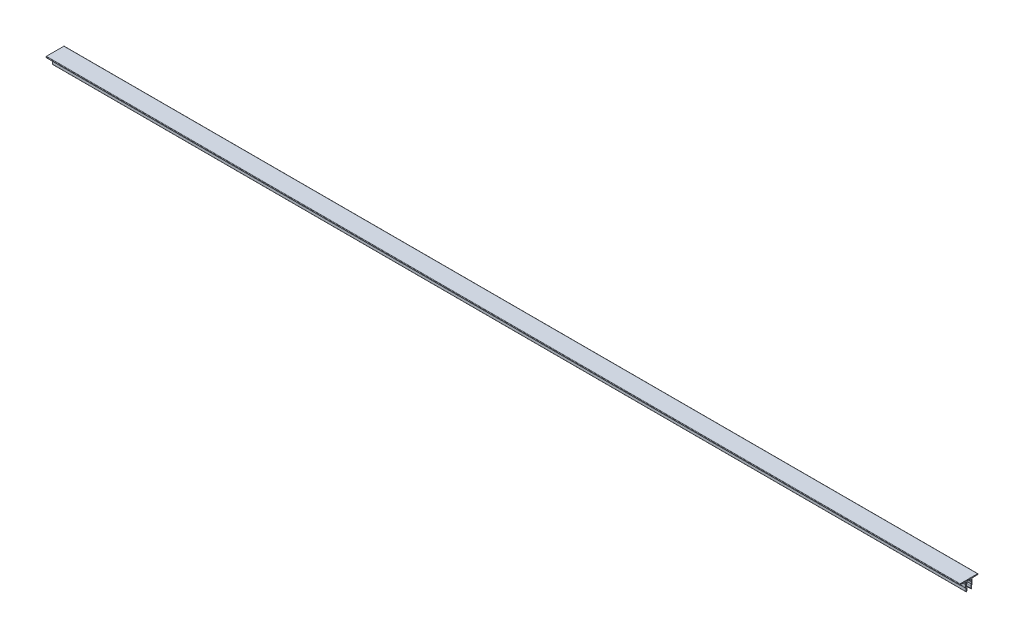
ISO-10303-21;
HEADER;
FILE_DESCRIPTION(('STEP AP214'),'2;1');
FILE_NAME('part.step','',(''),(''),'','','');
FILE_SCHEMA(('AUTOMOTIVE_DESIGN { 1 0 10303 214 1 1 1 1 }'));
ENDSEC;
DATA;
#1=APPLICATION_CONTEXT('core data for automotive mechanical design processes');
#2=APPLICATION_PROTOCOL_DEFINITION('international standard','automotive_design',2000,#1);
#3=PRODUCT_CONTEXT('',#1,'mechanical');
#4=PRODUCT('Part','Part','',(#3));
#5=PRODUCT_RELATED_PRODUCT_CATEGORY('part','',(#4));
#6=PRODUCT_DEFINITION_FORMATION('','',#4);
#7=PRODUCT_DEFINITION_CONTEXT('part definition',#1,'design');
#8=PRODUCT_DEFINITION('design','',#6,#7);
#9=PRODUCT_DEFINITION_SHAPE('','',#8);
#10=(LENGTH_UNIT() NAMED_UNIT(*) SI_UNIT(.MILLI.,.METRE.));
#11=(NAMED_UNIT(*) PLANE_ANGLE_UNIT() SI_UNIT($,.RADIAN.));
#12=(NAMED_UNIT(*) SI_UNIT($,.STERADIAN.) SOLID_ANGLE_UNIT());
#13=UNCERTAINTY_MEASURE_WITH_UNIT(LENGTH_MEASURE(1.E-05),#10,'distance_accuracy_value','');
#14=(GEOMETRIC_REPRESENTATION_CONTEXT(3) GLOBAL_UNCERTAINTY_ASSIGNED_CONTEXT((#13)) GLOBAL_UNIT_ASSIGNED_CONTEXT((#10,
#11,#12)) REPRESENTATION_CONTEXT('',''));
#15=CARTESIAN_POINT('',(0.,0.,0.));
#16=DIRECTION('',(0.,0.,1.));
#17=DIRECTION('',(1.,0.,0.));
#18=AXIS2_PLACEMENT_3D('',#15,#16,#17);
#19=CARTESIAN_POINT('',(1000.,-0.999999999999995,-10.));
#20=DIRECTION('',(0.,1.,0.));
#21=DIRECTION('',(0.,0.,1.));
#22=AXIS2_PLACEMENT_3D('',#19,#20,#21);
#23=PLANE('',#22);
#24=DIRECTION('',(0.,0.,-1.));
#25=VECTOR('',#24,1.);
#26=CARTESIAN_POINT('',(0.,-0.999999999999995,-10.));
#27=LINE('',#26,#25);
#28=CARTESIAN_POINT('',(0.,-0.999999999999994,-3.99999999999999));
#29=VERTEX_POINT('',#28);
#30=CARTESIAN_POINT('',(0.,-0.999999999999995,-10.));
#31=VERTEX_POINT('',#30);
#32=EDGE_CURVE('E361',#29,#31,#27,.T.);
#33=ORIENTED_EDGE('',*,*,#32,.T.);
#34=DIRECTION('',(-1.,0.,0.));
#35=VECTOR('',#34,1.);
#36=CARTESIAN_POINT('',(1000.,-0.999999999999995,-10.));
#37=LINE('',#36,#35);
#38=CARTESIAN_POINT('',(1000.,-0.999999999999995,-10.));
#39=VERTEX_POINT('',#38);
#40=EDGE_CURVE('E11',#39,#31,#37,.T.);
#41=ORIENTED_EDGE('',*,*,#40,.F.);
#42=DIRECTION('',(0.,0.,-1.));
#43=VECTOR('',#42,1.);
#44=CARTESIAN_POINT('',(1000.,-0.999999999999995,-10.));
#45=LINE('',#44,#43);
#46=CARTESIAN_POINT('',(1000.,-0.999999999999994,-3.99999999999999));
#47=VERTEX_POINT('',#46);
#48=EDGE_CURVE('E451',#47,#39,#45,.T.);
#49=ORIENTED_EDGE('',*,*,#48,.F.);
#50=DIRECTION('',(-1.,0.,0.));
#51=VECTOR('',#50,1.);
#52=CARTESIAN_POINT('',(1000.,-0.999999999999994,-3.99999999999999));
#53=LINE('',#52,#51);
#54=EDGE_CURVE('E357',#47,#29,#53,.T.);
#55=ORIENTED_EDGE('',*,*,#54,.T.);
#56=EDGE_LOOP('',(#33,#41,#49,#55));
#57=FACE_BOUND('',#56,.T.);
#58=ADVANCED_FACE('F37',(#57),#23,.F.);
#59=CARTESIAN_POINT('',(1000.,-0.999999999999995,-10.));
#60=DIRECTION('',(0.,0.,1.));
#61=DIRECTION('',(1.,0.,0.));
#62=AXIS2_PLACEMENT_3D('',#59,#60,#61);
#63=PLANE('',#62);
#64=DIRECTION('',(0.,1.,0.));
#65=VECTOR('',#64,1.);
#66=CARTESIAN_POINT('',(0.,-0.999999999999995,-10.));
#67=LINE('',#66,#65);
#68=CARTESIAN_POINT('',(0.,-0.500000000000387,-10.));
#69=VERTEX_POINT('',#68);
#70=EDGE_CURVE('E364',#31,#69,#67,.T.);
#71=ORIENTED_EDGE('',*,*,#70,.T.);
#72=DIRECTION('',(-1.,0.,0.));
#73=VECTOR('',#72,1.);
#74=CARTESIAN_POINT('',(1000.,-0.500000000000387,-10.));
#75=LINE('',#74,#73);
#76=CARTESIAN_POINT('',(1000.,-0.500000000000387,-10.));
#77=VERTEX_POINT('',#76);
#78=EDGE_CURVE('E45',#77,#69,#75,.T.);
#79=ORIENTED_EDGE('',*,*,#78,.F.);
#80=DIRECTION('',(0.,1.,0.));
#81=VECTOR('',#80,1.);
#82=CARTESIAN_POINT('',(1000.,-0.999999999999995,-10.));
#83=LINE('',#82,#81);
#84=EDGE_CURVE('E210',#39,#77,#83,.T.);
#85=ORIENTED_EDGE('',*,*,#84,.F.);
#86=ORIENTED_EDGE('',*,*,#40,.T.);
#87=EDGE_LOOP('',(#71,#79,#85,#86));
#88=FACE_BOUND('',#87,.T.);
#89=ADVANCED_FACE('F699',(#88),#63,.F.);
#90=CARTESIAN_POINT('',(1000.,-0.500000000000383,-9.5));
#91=DIRECTION('',(-1.,0.,0.));
#92=DIRECTION('',(0.,0.,1.));
#93=AXIS2_PLACEMENT_3D('',#90,#91,#92);
#94=CYLINDRICAL_SURFACE('',#93,0.5);
#95=CARTESIAN_POINT('',(0.,-0.500000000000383,-9.5));
#96=DIRECTION('',(1.,0.,0.));
#97=DIRECTION('',(0.,0.,-1.));
#98=AXIS2_PLACEMENT_3D('',#95,#96,#97);
#99=CIRCLE('',#98,0.5);
#100=CARTESIAN_POINT('',(0.,-3.8294020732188E-13,-9.5));
#101=VERTEX_POINT('',#100);
#102=EDGE_CURVE('E366',#69,#101,#99,.T.);
#103=ORIENTED_EDGE('',*,*,#102,.T.);
#104=DIRECTION('',(-1.,0.,0.));
#105=VECTOR('',#104,1.);
#106=CARTESIAN_POINT('',(1000.,-3.8294020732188E-13,-9.5));
#107=LINE('',#106,#105);
#108=CARTESIAN_POINT('',(1000.,-3.8294020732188E-13,-9.5));
#109=VERTEX_POINT('',#108);
#110=EDGE_CURVE('E572',#109,#101,#107,.T.);
#111=ORIENTED_EDGE('',*,*,#110,.F.);
#112=CARTESIAN_POINT('',(1000.,-0.500000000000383,-9.5));
#113=DIRECTION('',(1.,0.,0.));
#114=DIRECTION('',(0.,0.,-1.));
#115=AXIS2_PLACEMENT_3D('',#112,#113,#114);
#116=CIRCLE('',#115,0.5);
#117=EDGE_CURVE('E580',#77,#109,#116,.T.);
#118=ORIENTED_EDGE('',*,*,#117,.F.);
#119=ORIENTED_EDGE('',*,*,#78,.T.);
#120=EDGE_LOOP('',(#103,#111,#118,#119));
#121=FACE_BOUND('',#120,.T.);
#122=ADVANCED_FACE('F578',(#121),#94,.T.);
#123=CARTESIAN_POINT('',(1000.,-3.83150692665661E-13,-9.5));
#124=DIRECTION('',(0.,-1.,0.));
#125=DIRECTION('',(0.,0.,-1.));
#126=AXIS2_PLACEMENT_3D('',#123,#124,#125);
#127=PLANE('',#126);
#128=DIRECTION('',(0.,0.,1.));
#129=VECTOR('',#128,1.);
#130=CARTESIAN_POINT('',(0.,-3.83150692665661E-13,-9.5));
#131=LINE('',#130,#129);
#132=CARTESIAN_POINT('',(0.,-3.83112190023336E-13,9.49999999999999));
#133=VERTEX_POINT('',#132);
#134=EDGE_CURVE('E368',#101,#133,#131,.T.);
#135=ORIENTED_EDGE('',*,*,#134,.T.);
#136=DIRECTION('',(-1.,0.,0.));
#137=VECTOR('',#136,1.);
#138=CARTESIAN_POINT('',(1000.,-3.83112190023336E-13,9.49999999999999));
#139=LINE('',#138,#137);
#140=CARTESIAN_POINT('',(1000.,-3.83112190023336E-13,9.49999999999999));
#141=VERTEX_POINT('',#140);
#142=EDGE_CURVE('E569',#141,#133,#139,.T.);
#143=ORIENTED_EDGE('',*,*,#142,.F.);
#144=DIRECTION('',(0.,0.,1.));
#145=VECTOR('',#144,1.);
#146=CARTESIAN_POINT('',(1000.,-3.83150692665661E-13,-9.5));
#147=LINE('',#146,#145);
#148=EDGE_CURVE('E598',#109,#141,#147,.T.);
#149=ORIENTED_EDGE('',*,*,#148,.F.);
#150=ORIENTED_EDGE('',*,*,#110,.T.);
#151=EDGE_LOOP('',(#135,#143,#149,#150));
#152=FACE_BOUND('',#151,.T.);
#153=ADVANCED_FACE('F589',(#152),#127,.F.);
#154=CARTESIAN_POINT('',(1000.,-0.500000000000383,9.5));
#155=DIRECTION('',(-1.,0.,0.));
#156=DIRECTION('',(0.,0.,1.));
#157=AXIS2_PLACEMENT_3D('',#154,#155,#156);
#158=CYLINDRICAL_SURFACE('',#157,0.499999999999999);
#159=CARTESIAN_POINT('',(0.,-0.500000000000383,9.5));
#160=DIRECTION('',(1.,0.,0.));
#161=DIRECTION('',(0.,0.,-1.));
#162=AXIS2_PLACEMENT_3D('',#159,#160,#161);
#163=CIRCLE('',#162,0.499999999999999);
#164=CARTESIAN_POINT('',(0.,-0.500000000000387,10.));
#165=VERTEX_POINT('',#164);
#166=EDGE_CURVE('E370',#133,#165,#163,.T.);
#167=ORIENTED_EDGE('',*,*,#166,.T.);
#168=DIRECTION('',(-1.,0.,0.));
#169=VECTOR('',#168,1.);
#170=CARTESIAN_POINT('',(1000.,-0.500000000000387,10.));
#171=LINE('',#170,#169);
#172=CARTESIAN_POINT('',(1000.,-0.500000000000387,10.));
#173=VERTEX_POINT('',#172);
#174=EDGE_CURVE('E566',#173,#165,#171,.T.);
#175=ORIENTED_EDGE('',*,*,#174,.F.);
#176=CARTESIAN_POINT('',(1000.,-0.500000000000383,9.5));
#177=DIRECTION('',(1.,0.,0.));
#178=DIRECTION('',(0.,0.,-1.));
#179=AXIS2_PLACEMENT_3D('',#176,#177,#178);
#180=CIRCLE('',#179,0.499999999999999);
#181=EDGE_CURVE('E595',#141,#173,#180,.T.);
#182=ORIENTED_EDGE('',*,*,#181,.F.);
#183=ORIENTED_EDGE('',*,*,#142,.T.);
#184=EDGE_LOOP('',(#167,#175,#182,#183));
#185=FACE_BOUND('',#184,.T.);
#186=ADVANCED_FACE('F593',(#185),#158,.T.);
#187=CARTESIAN_POINT('',(1000.,-0.999999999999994,10.));
#188=DIRECTION('',(0.,0.,-1.));
#189=DIRECTION('',(-1.,0.,0.));
#190=AXIS2_PLACEMENT_3D('',#187,#188,#189);
#191=PLANE('',#190);
#192=DIRECTION('',(0.,-1.,0.));
#193=VECTOR('',#192,1.);
#194=CARTESIAN_POINT('',(0.,-0.999999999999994,10.));
#195=LINE('',#194,#193);
#196=CARTESIAN_POINT('',(0.,-0.999999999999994,10.));
#197=VERTEX_POINT('',#196);
#198=EDGE_CURVE('E372',#165,#197,#195,.T.);
#199=ORIENTED_EDGE('',*,*,#198,.T.);
#200=DIRECTION('',(-1.,0.,0.));
#201=VECTOR('',#200,1.);
#202=CARTESIAN_POINT('',(1000.,-0.999999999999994,10.));
#203=LINE('',#202,#201);
#204=CARTESIAN_POINT('',(1000.,-0.999999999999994,10.));
#205=VERTEX_POINT('',#204);
#206=EDGE_CURVE('E563',#205,#197,#203,.T.);
#207=ORIENTED_EDGE('',*,*,#206,.F.);
#208=DIRECTION('',(0.,-1.,0.));
#209=VECTOR('',#208,1.);
#210=CARTESIAN_POINT('',(1000.,-0.999999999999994,10.));
#211=LINE('',#210,#209);
#212=EDGE_CURVE('E597',#173,#205,#211,.T.);
#213=ORIENTED_EDGE('',*,*,#212,.F.);
#214=ORIENTED_EDGE('',*,*,#174,.T.);
#215=EDGE_LOOP('',(#199,#207,#213,#214));
#216=FACE_BOUND('',#215,.T.);
#217=ADVANCED_FACE('F712',(#216),#191,.F.);
#218=CARTESIAN_POINT('',(1000.,-0.999999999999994,4.0000000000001));
#219=DIRECTION('',(0.,1.,0.));
#220=DIRECTION('',(0.,0.,1.));
#221=AXIS2_PLACEMENT_3D('',#218,#219,#220);
#222=PLANE('',#221);
#223=DIRECTION('',(0.,0.,-1.));
#224=VECTOR('',#223,1.);
#225=CARTESIAN_POINT('',(0.,-0.999999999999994,4.0000000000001));
#226=LINE('',#225,#224);
#227=CARTESIAN_POINT('',(0.,-0.999999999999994,4.0000000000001));
#228=VERTEX_POINT('',#227);
#229=EDGE_CURVE('E374',#197,#228,#226,.T.);
#230=ORIENTED_EDGE('',*,*,#229,.T.);
#231=DIRECTION('',(-1.,0.,0.));
#232=VECTOR('',#231,1.);
#233=CARTESIAN_POINT('',(1000.,-0.999999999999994,4.0000000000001));
#234=LINE('',#233,#232);
#235=CARTESIAN_POINT('',(1000.,-0.999999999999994,4.0000000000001));
#236=VERTEX_POINT('',#235);
#237=EDGE_CURVE('E560',#236,#228,#234,.T.);
#238=ORIENTED_EDGE('',*,*,#237,.F.);
#239=DIRECTION('',(0.,0.,-1.));
#240=VECTOR('',#239,1.);
#241=CARTESIAN_POINT('',(1000.,-0.999999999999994,4.0000000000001));
#242=LINE('',#241,#240);
#243=EDGE_CURVE('E600',#205,#236,#242,.T.);
#244=ORIENTED_EDGE('',*,*,#243,.F.);
#245=ORIENTED_EDGE('',*,*,#206,.T.);
#246=EDGE_LOOP('',(#230,#238,#244,#245));
#247=FACE_BOUND('',#246,.T.);
#248=ADVANCED_FACE('F715',(#247),#222,.F.);
#249=CARTESIAN_POINT('',(1000.,-1.79999999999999,4.00000000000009));
#250=DIRECTION('',(-1.,0.,0.));
#251=DIRECTION('',(0.,0.,1.));
#252=AXIS2_PLACEMENT_3D('',#249,#250,#251);
#253=CYLINDRICAL_SURFACE('',#252,0.8);
#254=CARTESIAN_POINT('',(0.,-1.79999999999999,4.00000000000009));
#255=DIRECTION('',(-1.,0.,0.));
#256=DIRECTION('',(0.,0.,1.));
#257=AXIS2_PLACEMENT_3D('',#254,#255,#256);
#258=CIRCLE('',#257,0.8);
#259=CARTESIAN_POINT('',(0.,-1.80000000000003,3.20000000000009));
#260=VERTEX_POINT('',#259);
#261=EDGE_CURVE('E376',#228,#260,#258,.T.);
#262=ORIENTED_EDGE('',*,*,#261,.T.);
#263=DIRECTION('',(-1.,0.,0.));
#264=VECTOR('',#263,1.);
#265=CARTESIAN_POINT('',(1000.,-1.80000000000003,3.20000000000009));
#266=LINE('',#265,#264);
#267=CARTESIAN_POINT('',(1000.,-1.80000000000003,3.20000000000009));
#268=VERTEX_POINT('',#267);
#269=EDGE_CURVE('E557',#268,#260,#266,.T.);
#270=ORIENTED_EDGE('',*,*,#269,.F.);
#271=CARTESIAN_POINT('',(1000.,-1.79999999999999,4.00000000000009));
#272=DIRECTION('',(-1.,0.,0.));
#273=DIRECTION('',(0.,0.,1.));
#274=AXIS2_PLACEMENT_3D('',#271,#272,#273);
#275=CIRCLE('',#274,0.8);
#276=EDGE_CURVE('E606',#236,#268,#275,.T.);
#277=ORIENTED_EDGE('',*,*,#276,.F.);
#278=ORIENTED_EDGE('',*,*,#237,.T.);
#279=EDGE_LOOP('',(#262,#270,#277,#278));
#280=FACE_BOUND('',#279,.T.);
#281=ADVANCED_FACE('F719',(#280),#253,.F.);
#282=CARTESIAN_POINT('',(1000.,-2.70000000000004,3.20000000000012));
#283=DIRECTION('',(0.,0.,-1.));
#284=DIRECTION('',(0.,1.,0.));
#285=AXIS2_PLACEMENT_3D('',#282,#283,#284);
#286=PLANE('',#285);
#287=DIRECTION('',(0.,-1.,0.));
#288=VECTOR('',#287,1.);
#289=CARTESIAN_POINT('',(0.,-2.70000000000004,3.20000000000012));
#290=LINE('',#289,#288);
#291=CARTESIAN_POINT('',(0.,-2.70000000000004,3.20000000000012));
#292=VERTEX_POINT('',#291);
#293=EDGE_CURVE('E378',#260,#292,#290,.T.);
#294=ORIENTED_EDGE('',*,*,#293,.T.);
#295=DIRECTION('',(-1.,0.,0.));
#296=VECTOR('',#295,1.);
#297=CARTESIAN_POINT('',(1000.,-2.70000000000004,3.20000000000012));
#298=LINE('',#297,#296);
#299=CARTESIAN_POINT('',(1000.,-2.70000000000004,3.20000000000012));
#300=VERTEX_POINT('',#299);
#301=EDGE_CURVE('E554',#300,#292,#298,.T.);
#302=ORIENTED_EDGE('',*,*,#301,.F.);
#303=DIRECTION('',(0.,-1.,0.));
#304=VECTOR('',#303,1.);
#305=CARTESIAN_POINT('',(1000.,-2.70000000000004,3.20000000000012));
#306=LINE('',#305,#304);
#307=EDGE_CURVE('E608',#268,#300,#306,.T.);
#308=ORIENTED_EDGE('',*,*,#307,.F.);
#309=ORIENTED_EDGE('',*,*,#269,.T.);
#310=EDGE_LOOP('',(#294,#302,#308,#309));
#311=FACE_BOUND('',#310,.T.);
#312=ADVANCED_FACE('F723',(#311),#286,.F.);
#313=CARTESIAN_POINT('',(1000.,-2.70000000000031,4.00000000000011));
#314=DIRECTION('',(-1.,0.,0.));
#315=DIRECTION('',(0.,0.,1.));
#316=AXIS2_PLACEMENT_3D('',#313,#314,#315);
#317=CYLINDRICAL_SURFACE('',#316,0.799999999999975);
#318=CARTESIAN_POINT('',(0.,-2.70000000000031,4.00000000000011));
#319=DIRECTION('',(-1.,0.,0.));
#320=DIRECTION('',(0.,0.,-1.));
#321=AXIS2_PLACEMENT_3D('',#318,#319,#320);
#322=CIRCLE('',#321,0.799999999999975);
#323=CARTESIAN_POINT('',(0.,-3.33058158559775,3.50769230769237));
#324=VERTEX_POINT('',#323);
#325=EDGE_CURVE('E380',#292,#324,#322,.T.);
#326=ORIENTED_EDGE('',*,*,#325,.T.);
#327=DIRECTION('',(-1.,0.,0.));
#328=VECTOR('',#327,1.);
#329=CARTESIAN_POINT('',(1000.,-3.33058158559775,3.50769230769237));
#330=LINE('',#329,#328);
#331=CARTESIAN_POINT('',(1000.,-3.33058158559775,3.50769230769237));
#332=VERTEX_POINT('',#331);
#333=EDGE_CURVE('E551',#332,#324,#330,.T.);
#334=ORIENTED_EDGE('',*,*,#333,.F.);
#335=CARTESIAN_POINT('',(1000.,-2.70000000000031,4.00000000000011));
#336=DIRECTION('',(-1.,0.,0.));
#337=DIRECTION('',(0.,0.,-1.));
#338=AXIS2_PLACEMENT_3D('',#335,#336,#337);
#339=CIRCLE('',#338,0.799999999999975);
#340=EDGE_CURVE('E610',#300,#332,#339,.T.);
#341=ORIENTED_EDGE('',*,*,#340,.F.);
#342=ORIENTED_EDGE('',*,*,#301,.T.);
#343=EDGE_LOOP('',(#326,#334,#341,#342));
#344=FACE_BOUND('',#343,.T.);
#345=ADVANCED_FACE('F727',(#344),#317,.F.);
#346=CARTESIAN_POINT('',(1000.,-3.72469507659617,3.20000000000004));
#347=DIRECTION('',(-1.,0.,0.));
#348=DIRECTION('',(0.,0.,1.));
#349=AXIS2_PLACEMENT_3D('',#346,#347,#348);
#350=CYLINDRICAL_SURFACE('',#349,0.500000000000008);
#351=CARTESIAN_POINT('',(0.,-3.72469507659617,3.20000000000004));
#352=DIRECTION('',(1.,0.,0.));
#353=DIRECTION('',(0.,0.,-1.));
#354=AXIS2_PLACEMENT_3D('',#351,#352,#353);
#355=CIRCLE('',#354,0.500000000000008);
#356=CARTESIAN_POINT('',(0.,-3.72469507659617,3.70000000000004));
#357=VERTEX_POINT('',#356);
#358=EDGE_CURVE('E382',#324,#357,#355,.T.);
#359=ORIENTED_EDGE('',*,*,#358,.T.);
#360=DIRECTION('',(-1.,0.,0.));
#361=VECTOR('',#360,1.);
#362=CARTESIAN_POINT('',(1000.,-3.72469507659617,3.70000000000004));
#363=LINE('',#362,#361);
#364=CARTESIAN_POINT('',(1000.,-3.72469507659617,3.70000000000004));
#365=VERTEX_POINT('',#364);
#366=EDGE_CURVE('E548',#365,#357,#363,.T.);
#367=ORIENTED_EDGE('',*,*,#366,.F.);
#368=CARTESIAN_POINT('',(1000.,-3.72469507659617,3.20000000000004));
#369=DIRECTION('',(1.,0.,0.));
#370=DIRECTION('',(0.,0.,-1.));
#371=AXIS2_PLACEMENT_3D('',#368,#369,#370);
#372=CIRCLE('',#371,0.500000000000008);
#373=EDGE_CURVE('E612',#332,#365,#372,.T.);
#374=ORIENTED_EDGE('',*,*,#373,.F.);
#375=ORIENTED_EDGE('',*,*,#333,.T.);
#376=EDGE_LOOP('',(#359,#367,#374,#375));
#377=FACE_BOUND('',#376,.T.);
#378=ADVANCED_FACE('F731',(#377),#350,.T.);
#379=CARTESIAN_POINT('',(1000.,-6.64724902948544,3.70000000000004));
#380=DIRECTION('',(0.,0.,-1.));
#381=DIRECTION('',(-1.,0.,0.));
#382=AXIS2_PLACEMENT_3D('',#379,#380,#381);
#383=PLANE('',#382);
#384=DIRECTION('',(0.,-1.,0.));
#385=VECTOR('',#384,1.);
#386=CARTESIAN_POINT('',(0.,-6.64724902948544,3.70000000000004));
#387=LINE('',#386,#385);
#388=CARTESIAN_POINT('',(0.,-6.64724902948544,3.70000000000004));
#389=VERTEX_POINT('',#388);
#390=EDGE_CURVE('E384',#357,#389,#387,.T.);
#391=ORIENTED_EDGE('',*,*,#390,.T.);
#392=DIRECTION('',(-1.,0.,0.));
#393=VECTOR('',#392,1.);
#394=CARTESIAN_POINT('',(1000.,-6.64724902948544,3.70000000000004));
#395=LINE('',#394,#393);
#396=CARTESIAN_POINT('',(1000.,-6.64724902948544,3.70000000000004));
#397=VERTEX_POINT('',#396);
#398=EDGE_CURVE('E545',#397,#389,#395,.T.);
#399=ORIENTED_EDGE('',*,*,#398,.F.);
#400=DIRECTION('',(0.,-1.,0.));
#401=VECTOR('',#400,1.);
#402=CARTESIAN_POINT('',(1000.,-6.64724902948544,3.70000000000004));
#403=LINE('',#402,#401);
#404=EDGE_CURVE('E614',#365,#397,#403,.T.);
#405=ORIENTED_EDGE('',*,*,#404,.F.);
#406=ORIENTED_EDGE('',*,*,#366,.T.);
#407=EDGE_LOOP('',(#391,#399,#405,#406));
#408=FACE_BOUND('',#407,.T.);
#409=ADVANCED_FACE('F735',(#408),#383,.F.);
#410=CARTESIAN_POINT('',(1000.,-6.64724902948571,3.20000000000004));
#411=DIRECTION('',(-1.,0.,0.));
#412=DIRECTION('',(0.,0.,1.));
#413=AXIS2_PLACEMENT_3D('',#410,#411,#412);
#414=CYLINDRICAL_SURFACE('',#413,0.499999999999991);
#415=CARTESIAN_POINT('',(0.,-6.64724902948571,3.20000000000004));
#416=DIRECTION('',(1.,0.,0.));
#417=DIRECTION('',(0.,0.,-1.));
#418=AXIS2_PLACEMENT_3D('',#415,#416,#417);
#419=CIRCLE('',#418,0.499999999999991);
#420=CARTESIAN_POINT('',(0.,-7.08026173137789,3.4500000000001));
#421=VERTEX_POINT('',#420);
#422=EDGE_CURVE('E386',#389,#421,#419,.T.);
#423=ORIENTED_EDGE('',*,*,#422,.T.);
#424=DIRECTION('',(-1.,0.,0.));
#425=VECTOR('',#424,1.);
#426=CARTESIAN_POINT('',(1000.,-7.08026173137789,3.4500000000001));
#427=LINE('',#426,#425);
#428=CARTESIAN_POINT('',(1000.,-7.08026173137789,3.4500000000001));
#429=VERTEX_POINT('',#428);
#430=EDGE_CURVE('E542',#429,#421,#427,.T.);
#431=ORIENTED_EDGE('',*,*,#430,.F.);
#432=CARTESIAN_POINT('',(1000.,-6.64724902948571,3.20000000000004));
#433=DIRECTION('',(1.,0.,0.));
#434=DIRECTION('',(0.,0.,-1.));
#435=AXIS2_PLACEMENT_3D('',#432,#433,#434);
#436=CIRCLE('',#435,0.499999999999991);
#437=EDGE_CURVE('E616',#397,#429,#436,.T.);
#438=ORIENTED_EDGE('',*,*,#437,.F.);
#439=ORIENTED_EDGE('',*,*,#398,.T.);
#440=EDGE_LOOP('',(#423,#431,#438,#439));
#441=FACE_BOUND('',#440,.T.);
#442=ADVANCED_FACE('F739',(#441),#414,.T.);
#443=CARTESIAN_POINT('',(1000.,-7.68647951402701,3.80000000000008));
#444=DIRECTION('',(-1.,0.,0.));
#445=DIRECTION('',(0.,0.,1.));
#446=AXIS2_PLACEMENT_3D('',#443,#444,#445);
#447=CYLINDRICAL_SURFACE('',#446,0.700000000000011);
#448=CARTESIAN_POINT('',(0.,-7.68647951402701,3.80000000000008));
#449=DIRECTION('',(-1.,0.,0.));
#450=DIRECTION('',(0.,0.,-1.));
#451=AXIS2_PLACEMENT_3D('',#448,#449,#450);
#452=CIRCLE('',#451,0.700000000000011);
#453=CARTESIAN_POINT('',(0.,-7.68647951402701,3.10000000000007));
#454=VERTEX_POINT('',#453);
#455=EDGE_CURVE('E388',#421,#454,#452,.T.);
#456=ORIENTED_EDGE('',*,*,#455,.T.);
#457=DIRECTION('',(-1.,0.,0.));
#458=VECTOR('',#457,1.);
#459=CARTESIAN_POINT('',(1000.,-7.68647951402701,3.10000000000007));
#460=LINE('',#459,#458);
#461=CARTESIAN_POINT('',(1000.,-7.68647951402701,3.10000000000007));
#462=VERTEX_POINT('',#461);
#463=EDGE_CURVE('E539',#462,#454,#460,.T.);
#464=ORIENTED_EDGE('',*,*,#463,.F.);
#465=CARTESIAN_POINT('',(1000.,-7.68647951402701,3.80000000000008));
#466=DIRECTION('',(-1.,0.,0.));
#467=DIRECTION('',(0.,0.,-1.));
#468=AXIS2_PLACEMENT_3D('',#465,#466,#467);
#469=CIRCLE('',#468,0.700000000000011);
#470=EDGE_CURVE('E618',#429,#462,#469,.T.);
#471=ORIENTED_EDGE('',*,*,#470,.F.);
#472=ORIENTED_EDGE('',*,*,#430,.T.);
#473=EDGE_LOOP('',(#456,#464,#471,#472));
#474=FACE_BOUND('',#473,.T.);
#475=ADVANCED_FACE('F743',(#474),#447,.F.);
#476=CARTESIAN_POINT('',(1000.,-10.7,3.10000000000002));
#477=DIRECTION('',(0.,0.,-1.));
#478=DIRECTION('',(0.,1.,0.));
#479=AXIS2_PLACEMENT_3D('',#476,#477,#478);
#480=PLANE('',#479);
#481=DIRECTION('',(0.,-1.,0.));
#482=VECTOR('',#481,1.);
#483=CARTESIAN_POINT('',(0.,-10.7,3.10000000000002));
#484=LINE('',#483,#482);
#485=CARTESIAN_POINT('',(0.,-10.7,3.10000000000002));
#486=VERTEX_POINT('',#485);
#487=EDGE_CURVE('E390',#454,#486,#484,.T.);
#488=ORIENTED_EDGE('',*,*,#487,.T.);
#489=DIRECTION('',(-1.,0.,0.));
#490=VECTOR('',#489,1.);
#491=CARTESIAN_POINT('',(1000.,-10.7,3.10000000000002));
#492=LINE('',#491,#490);
#493=CARTESIAN_POINT('',(1000.,-10.7,3.10000000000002));
#494=VERTEX_POINT('',#493);
#495=EDGE_CURVE('E536',#494,#486,#492,.T.);
#496=ORIENTED_EDGE('',*,*,#495,.F.);
#497=DIRECTION('',(0.,-1.,0.));
#498=VECTOR('',#497,1.);
#499=CARTESIAN_POINT('',(1000.,-10.7,3.10000000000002));
#500=LINE('',#499,#498);
#501=EDGE_CURVE('E620',#462,#494,#500,.T.);
#502=ORIENTED_EDGE('',*,*,#501,.F.);
#503=ORIENTED_EDGE('',*,*,#463,.T.);
#504=EDGE_LOOP('',(#488,#496,#502,#503));
#505=FACE_BOUND('',#504,.T.);
#506=ADVANCED_FACE('F747',(#505),#480,.F.);
#507=CARTESIAN_POINT('',(1000.,-10.7,2.80000000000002));
#508=DIRECTION('',(-1.,0.,0.));
#509=DIRECTION('',(0.,0.,1.));
#510=AXIS2_PLACEMENT_3D('',#507,#508,#509);
#511=CYLINDRICAL_SURFACE('',#510,0.299999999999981);
#512=CARTESIAN_POINT('',(0.,-10.7,2.80000000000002));
#513=DIRECTION('',(1.,0.,0.));
#514=DIRECTION('',(0.,0.,-1.));
#515=AXIS2_PLACEMENT_3D('',#512,#513,#514);
#516=CIRCLE('',#515,0.299999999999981);
#517=CARTESIAN_POINT('',(0.,-11.,2.80000000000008));
#518=VERTEX_POINT('',#517);
#519=EDGE_CURVE('E392',#486,#518,#516,.T.);
#520=ORIENTED_EDGE('',*,*,#519,.T.);
#521=DIRECTION('',(-1.,0.,0.));
#522=VECTOR('',#521,1.);
#523=CARTESIAN_POINT('',(1000.,-11.,2.80000000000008));
#524=LINE('',#523,#522);
#525=CARTESIAN_POINT('',(1000.,-11.,2.80000000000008));
#526=VERTEX_POINT('',#525);
#527=EDGE_CURVE('E533',#526,#518,#524,.T.);
#528=ORIENTED_EDGE('',*,*,#527,.F.);
#529=CARTESIAN_POINT('',(1000.,-10.7,2.80000000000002));
#530=DIRECTION('',(1.,0.,0.));
#531=DIRECTION('',(0.,0.,-1.));
#532=AXIS2_PLACEMENT_3D('',#529,#530,#531);
#533=CIRCLE('',#532,0.299999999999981);
#534=EDGE_CURVE('E622',#494,#526,#533,.T.);
#535=ORIENTED_EDGE('',*,*,#534,.F.);
#536=ORIENTED_EDGE('',*,*,#495,.T.);
#537=EDGE_LOOP('',(#520,#528,#535,#536));
#538=FACE_BOUND('',#537,.T.);
#539=ADVANCED_FACE('F751',(#538),#511,.T.);
#540=CARTESIAN_POINT('',(1000.,-11.0000000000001,2.60000000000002));
#541=DIRECTION('',(0.,1.,-2.77555756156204E-13));
#542=DIRECTION('',(0.,2.77555756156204E-13,1.));
#543=AXIS2_PLACEMENT_3D('',#540,#541,#542);
#544=PLANE('',#543);
#545=DIRECTION('',(0.,-2.77555756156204E-13,-1.));
#546=VECTOR('',#545,1.);
#547=CARTESIAN_POINT('',(0.,-11.0000000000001,2.60000000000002));
#548=LINE('',#547,#546);
#549=CARTESIAN_POINT('',(0.,-11.0000000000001,2.60000000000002));
#550=VERTEX_POINT('',#549);
#551=EDGE_CURVE('E394',#518,#550,#548,.T.);
#552=ORIENTED_EDGE('',*,*,#551,.T.);
#553=DIRECTION('',(-1.,0.,0.));
#554=VECTOR('',#553,1.);
#555=CARTESIAN_POINT('',(1000.,-11.0000000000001,2.60000000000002));
#556=LINE('',#555,#554);
#557=CARTESIAN_POINT('',(1000.,-11.0000000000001,2.60000000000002));
#558=VERTEX_POINT('',#557);
#559=EDGE_CURVE('E530',#558,#550,#556,.T.);
#560=ORIENTED_EDGE('',*,*,#559,.F.);
#561=DIRECTION('',(0.,-2.77555756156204E-13,-1.));
#562=VECTOR('',#561,1.);
#563=CARTESIAN_POINT('',(1000.,-11.0000000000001,2.60000000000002));
#564=LINE('',#563,#562);
#565=EDGE_CURVE('E624',#526,#558,#564,.T.);
#566=ORIENTED_EDGE('',*,*,#565,.F.);
#567=ORIENTED_EDGE('',*,*,#527,.T.);
#568=EDGE_LOOP('',(#552,#560,#566,#567));
#569=FACE_BOUND('',#568,.T.);
#570=ADVANCED_FACE('F755',(#569),#544,.F.);
#571=CARTESIAN_POINT('',(1000.,-10.1339745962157,2.10000000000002));
#572=DIRECTION('',(0.,0.500000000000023,0.866025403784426));
#573=DIRECTION('',(0.,-0.866025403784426,0.500000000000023));
#574=AXIS2_PLACEMENT_3D('',#571,#572,#573);
#575=PLANE('',#574);
#576=DIRECTION('',(0.,0.866025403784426,-0.500000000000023));
#577=VECTOR('',#576,1.);
#578=CARTESIAN_POINT('',(0.,-10.1339745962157,2.10000000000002));
#579=LINE('',#578,#577);
#580=CARTESIAN_POINT('',(0.,-10.1339745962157,2.10000000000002));
#581=VERTEX_POINT('',#580);
#582=EDGE_CURVE('E396',#550,#581,#579,.T.);
#583=ORIENTED_EDGE('',*,*,#582,.T.);
#584=DIRECTION('',(-1.,0.,0.));
#585=VECTOR('',#584,1.);
#586=CARTESIAN_POINT('',(1000.,-10.1339745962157,2.10000000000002));
#587=LINE('',#586,#585);
#588=CARTESIAN_POINT('',(1000.,-10.1339745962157,2.10000000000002));
#589=VERTEX_POINT('',#588);
#590=EDGE_CURVE('E527',#589,#581,#587,.T.);
#591=ORIENTED_EDGE('',*,*,#590,.F.);
#592=DIRECTION('',(0.,0.866025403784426,-0.500000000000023));
#593=VECTOR('',#592,1.);
#594=CARTESIAN_POINT('',(1000.,-10.1339745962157,2.10000000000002));
#595=LINE('',#594,#593);
#596=EDGE_CURVE('E626',#558,#589,#595,.T.);
#597=ORIENTED_EDGE('',*,*,#596,.F.);
#598=ORIENTED_EDGE('',*,*,#559,.T.);
#599=EDGE_LOOP('',(#583,#591,#597,#598));
#600=FACE_BOUND('',#599,.T.);
#601=ADVANCED_FACE('F759',(#600),#575,.F.);
#602=CARTESIAN_POINT('',(1000.,-10.1339745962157,2.10000000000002));
#603=DIRECTION('',(0.,0.,1.));
#604=DIRECTION('',(1.,0.,0.));
#605=AXIS2_PLACEMENT_3D('',#602,#603,#604);
#606=PLANE('',#605);
#607=DIRECTION('',(0.,1.,0.));
#608=VECTOR('',#607,1.);
#609=CARTESIAN_POINT('',(0.,-10.1339745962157,2.10000000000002));
#610=LINE('',#609,#608);
#611=CARTESIAN_POINT('',(0.,-7.68647951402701,2.10000000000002));
#612=VERTEX_POINT('',#611);
#613=EDGE_CURVE('E398',#581,#612,#610,.T.);
#614=ORIENTED_EDGE('',*,*,#613,.T.);
#615=DIRECTION('',(-1.,0.,0.));
#616=VECTOR('',#615,1.);
#617=CARTESIAN_POINT('',(1000.,-7.68647951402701,2.10000000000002));
#618=LINE('',#617,#616);
#619=CARTESIAN_POINT('',(1000.,-7.68647951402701,2.10000000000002));
#620=VERTEX_POINT('',#619);
#621=EDGE_CURVE('E524',#620,#612,#618,.T.);
#622=ORIENTED_EDGE('',*,*,#621,.F.);
#623=DIRECTION('',(0.,1.,0.));
#624=VECTOR('',#623,1.);
#625=CARTESIAN_POINT('',(1000.,-10.1339745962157,2.10000000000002));
#626=LINE('',#625,#624);
#627=EDGE_CURVE('E628',#589,#620,#626,.T.);
#628=ORIENTED_EDGE('',*,*,#627,.F.);
#629=ORIENTED_EDGE('',*,*,#590,.T.);
#630=EDGE_LOOP('',(#614,#622,#628,#629));
#631=FACE_BOUND('',#630,.T.);
#632=ADVANCED_FACE('F763',(#631),#606,.F.);
#633=CARTESIAN_POINT('',(1000.,-7.68647951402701,3.80000000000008));
#634=DIRECTION('',(-1.,0.,0.));
#635=DIRECTION('',(0.,0.,1.));
#636=AXIS2_PLACEMENT_3D('',#633,#634,#635);
#637=CYLINDRICAL_SURFACE('',#636,1.70000000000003);
#638=CARTESIAN_POINT('',(0.,-7.68647951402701,3.80000000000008));
#639=DIRECTION('',(1.,0.,0.));
#640=DIRECTION('',(0.,0.,-1.));
#641=AXIS2_PLACEMENT_3D('',#638,#639,#640);
#642=CIRCLE('',#641,1.70000000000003);
#643=CARTESIAN_POINT('',(0.,-6.5196869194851,2.56363636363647));
#644=VERTEX_POINT('',#643);
#645=EDGE_CURVE('E400',#612,#644,#642,.T.);
#646=ORIENTED_EDGE('',*,*,#645,.T.);
#647=DIRECTION('',(-1.,0.,0.));
#648=VECTOR('',#647,1.);
#649=CARTESIAN_POINT('',(1000.,-6.5196869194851,2.56363636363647));
#650=LINE('',#649,#648);
#651=CARTESIAN_POINT('',(1000.,-6.5196869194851,2.56363636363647));
#652=VERTEX_POINT('',#651);
#653=EDGE_CURVE('E521',#652,#644,#650,.T.);
#654=ORIENTED_EDGE('',*,*,#653,.F.);
#655=CARTESIAN_POINT('',(1000.,-7.68647951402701,3.80000000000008));
#656=DIRECTION('',(1.,0.,0.));
#657=DIRECTION('',(0.,0.,-1.));
#658=AXIS2_PLACEMENT_3D('',#655,#656,#657);
#659=CIRCLE('',#658,1.70000000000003);
#660=EDGE_CURVE('E630',#620,#652,#659,.T.);
#661=ORIENTED_EDGE('',*,*,#660,.F.);
#662=ORIENTED_EDGE('',*,*,#621,.T.);
#663=EDGE_LOOP('',(#646,#654,#661,#662));
#664=FACE_BOUND('',#663,.T.);
#665=ADVANCED_FACE('F767',(#664),#637,.T.);
#666=CARTESIAN_POINT('',(1000.,-6.17651262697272,2.20000000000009));
#667=DIRECTION('',(-1.,0.,0.));
#668=DIRECTION('',(0.,0.,1.));
#669=AXIS2_PLACEMENT_3D('',#666,#667,#668);
#670=CYLINDRICAL_SURFACE('',#669,0.500000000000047);
#671=CARTESIAN_POINT('',(0.,-6.17651262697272,2.20000000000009));
#672=DIRECTION('',(-1.,0.,0.));
#673=DIRECTION('',(0.,0.,-1.));
#674=AXIS2_PLACEMENT_3D('',#671,#672,#673);
#675=CIRCLE('',#674,0.500000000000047);
#676=CARTESIAN_POINT('',(0.,-6.17651262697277,2.70000000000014));
#677=VERTEX_POINT('',#676);
#678=EDGE_CURVE('E402',#644,#677,#675,.T.);
#679=ORIENTED_EDGE('',*,*,#678,.T.);
#680=DIRECTION('',(-1.,0.,0.));
#681=VECTOR('',#680,1.);
#682=CARTESIAN_POINT('',(1000.,-6.17651262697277,2.70000000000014));
#683=LINE('',#682,#681);
#684=CARTESIAN_POINT('',(1000.,-6.17651262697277,2.70000000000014));
#685=VERTEX_POINT('',#684);
#686=EDGE_CURVE('E518',#685,#677,#683,.T.);
#687=ORIENTED_EDGE('',*,*,#686,.F.);
#688=CARTESIAN_POINT('',(1000.,-6.17651262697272,2.20000000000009));
#689=DIRECTION('',(-1.,0.,0.));
#690=DIRECTION('',(0.,0.,-1.));
#691=AXIS2_PLACEMENT_3D('',#688,#689,#690);
#692=CIRCLE('',#691,0.500000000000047);
#693=EDGE_CURVE('E632',#652,#685,#692,.T.);
#694=ORIENTED_EDGE('',*,*,#693,.F.);
#695=ORIENTED_EDGE('',*,*,#653,.T.);
#696=EDGE_LOOP('',(#679,#687,#694,#695));
#697=FACE_BOUND('',#696,.T.);
#698=ADVANCED_FACE('F771',(#697),#670,.F.);
#699=CARTESIAN_POINT('',(1000.,-6.17651262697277,2.70000000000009));
#700=DIRECTION('',(0.,0.,1.));
#701=DIRECTION('',(0.,-1.,0.));
#702=AXIS2_PLACEMENT_3D('',#699,#700,#701);
#703=PLANE('',#702);
#704=DIRECTION('',(0.,1.,0.));
#705=VECTOR('',#704,1.);
#706=CARTESIAN_POINT('',(0.,-6.17651262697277,2.70000000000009));
#707=LINE('',#706,#705);
#708=CARTESIAN_POINT('',(0.,-4.29021138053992,2.70000000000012));
#709=VERTEX_POINT('',#708);
#710=EDGE_CURVE('E404',#677,#709,#707,.T.);
#711=ORIENTED_EDGE('',*,*,#710,.T.);
#712=DIRECTION('',(-1.,0.,0.));
#713=VECTOR('',#712,1.);
#714=CARTESIAN_POINT('',(1000.,-4.29021138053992,2.70000000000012));
#715=LINE('',#714,#713);
#716=CARTESIAN_POINT('',(1000.,-4.29021138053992,2.70000000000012));
#717=VERTEX_POINT('',#716);
#718=EDGE_CURVE('E515',#717,#709,#715,.T.);
#719=ORIENTED_EDGE('',*,*,#718,.F.);
#720=DIRECTION('',(0.,1.,0.));
#721=VECTOR('',#720,1.);
#722=CARTESIAN_POINT('',(1000.,-6.17651262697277,2.70000000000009));
#723=LINE('',#722,#721);
#724=EDGE_CURVE('E634',#685,#717,#723,.T.);
#725=ORIENTED_EDGE('',*,*,#724,.F.);
#726=ORIENTED_EDGE('',*,*,#686,.T.);
#727=EDGE_LOOP('',(#711,#719,#725,#726));
#728=FACE_BOUND('',#727,.T.);
#729=ADVANCED_FACE('F775',(#728),#703,.F.);
#730=CARTESIAN_POINT('',(1000.,-4.29021138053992,2.20000000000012));
#731=DIRECTION('',(-1.,0.,0.));
#732=DIRECTION('',(0.,0.,1.));
#733=AXIS2_PLACEMENT_3D('',#730,#731,#732);
#734=CYLINDRICAL_SURFACE('',#733,0.499999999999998);
#735=CARTESIAN_POINT('',(0.,-4.29021138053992,2.20000000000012));
#736=DIRECTION('',(-1.,0.,0.));
#737=DIRECTION('',(0.,0.,-1.));
#738=AXIS2_PLACEMENT_3D('',#735,#736,#737);
#739=CIRCLE('',#738,0.499999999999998);
#740=CARTESIAN_POINT('',(0.,-3.85719867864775,2.45000000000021));
#741=VERTEX_POINT('',#740);
#742=EDGE_CURVE('E406',#709,#741,#739,.T.);
#743=ORIENTED_EDGE('',*,*,#742,.T.);
#744=DIRECTION('',(-1.,0.,0.));
#745=VECTOR('',#744,1.);
#746=CARTESIAN_POINT('',(1000.,-3.85719867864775,2.45000000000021));
#747=LINE('',#746,#745);
#748=CARTESIAN_POINT('',(1000.,-3.85719867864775,2.45000000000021));
#749=VERTEX_POINT('',#748);
#750=EDGE_CURVE('E512',#749,#741,#747,.T.);
#751=ORIENTED_EDGE('',*,*,#750,.F.);
#752=CARTESIAN_POINT('',(1000.,-4.29021138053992,2.20000000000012));
#753=DIRECTION('',(-1.,0.,0.));
#754=DIRECTION('',(0.,0.,-1.));
#755=AXIS2_PLACEMENT_3D('',#752,#753,#754);
#756=CIRCLE('',#755,0.499999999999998);
#757=EDGE_CURVE('E636',#717,#749,#756,.T.);
#758=ORIENTED_EDGE('',*,*,#757,.F.);
#759=ORIENTED_EDGE('',*,*,#718,.T.);
#760=EDGE_LOOP('',(#743,#751,#758,#759));
#761=FACE_BOUND('',#760,.T.);
#762=ADVANCED_FACE('F779',(#761),#734,.F.);
#763=CARTESIAN_POINT('',(1000.,-3.42418597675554,2.70000000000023));
#764=DIRECTION('',(-1.,0.,0.));
#765=DIRECTION('',(0.,0.,1.));
#766=AXIS2_PLACEMENT_3D('',#763,#764,#765);
#767=CYLINDRICAL_SURFACE('',#766,0.500000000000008);
#768=CARTESIAN_POINT('',(0.,-3.42418597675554,2.70000000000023));
#769=DIRECTION('',(1.,0.,0.));
#770=DIRECTION('',(0.,0.,-1.));
#771=AXIS2_PLACEMENT_3D('',#768,#769,#770);
#772=CIRCLE('',#771,0.500000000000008);
#773=CARTESIAN_POINT('',(0.,-3.42418597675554,2.20000000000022));
#774=VERTEX_POINT('',#773);
#775=EDGE_CURVE('E408',#741,#774,#772,.T.);
#776=ORIENTED_EDGE('',*,*,#775,.T.);
#777=DIRECTION('',(-1.,0.,0.));
#778=VECTOR('',#777,1.);
#779=CARTESIAN_POINT('',(1000.,-3.42418597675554,2.20000000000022));
#780=LINE('',#779,#778);
#781=CARTESIAN_POINT('',(1000.,-3.42418597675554,2.20000000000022));
#782=VERTEX_POINT('',#781);
#783=EDGE_CURVE('E509',#782,#774,#780,.T.);
#784=ORIENTED_EDGE('',*,*,#783,.F.);
#785=CARTESIAN_POINT('',(1000.,-3.42418597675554,2.70000000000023));
#786=DIRECTION('',(1.,0.,0.));
#787=DIRECTION('',(0.,0.,-1.));
#788=AXIS2_PLACEMENT_3D('',#785,#786,#787);
#789=CIRCLE('',#788,0.500000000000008);
#790=EDGE_CURVE('E638',#749,#782,#789,.T.);
#791=ORIENTED_EDGE('',*,*,#790,.F.);
#792=ORIENTED_EDGE('',*,*,#750,.T.);
#793=EDGE_LOOP('',(#776,#784,#791,#792));
#794=FACE_BOUND('',#793,.T.);
#795=ADVANCED_FACE('F783',(#794),#767,.T.);
#796=CARTESIAN_POINT('',(1000.,-3.42418597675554,2.20000000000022));
#797=DIRECTION('',(0.,0.,1.));
#798=DIRECTION('',(1.,0.,0.));
#799=AXIS2_PLACEMENT_3D('',#796,#797,#798);
#800=PLANE('',#799);
#801=DIRECTION('',(0.,1.,0.));
#802=VECTOR('',#801,1.);
#803=CARTESIAN_POINT('',(0.,-3.42418597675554,2.20000000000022));
#804=LINE('',#803,#802);
#805=CARTESIAN_POINT('',(0.,-1.5,2.20000000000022));
#806=VERTEX_POINT('',#805);
#807=EDGE_CURVE('E410',#774,#806,#804,.T.);
#808=ORIENTED_EDGE('',*,*,#807,.T.);
#809=DIRECTION('',(-1.,0.,0.));
#810=VECTOR('',#809,1.);
#811=CARTESIAN_POINT('',(1000.,-1.5,2.20000000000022));
#812=LINE('',#811,#810);
#813=CARTESIAN_POINT('',(1000.,-1.5,2.20000000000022));
#814=VERTEX_POINT('',#813);
#815=EDGE_CURVE('E506',#814,#806,#812,.T.);
#816=ORIENTED_EDGE('',*,*,#815,.F.);
#817=DIRECTION('',(0.,1.,0.));
#818=VECTOR('',#817,1.);
#819=CARTESIAN_POINT('',(1000.,-3.42418597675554,2.20000000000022));
#820=LINE('',#819,#818);
#821=EDGE_CURVE('E640',#782,#814,#820,.T.);
#822=ORIENTED_EDGE('',*,*,#821,.F.);
#823=ORIENTED_EDGE('',*,*,#783,.T.);
#824=EDGE_LOOP('',(#808,#816,#822,#823));
#825=FACE_BOUND('',#824,.T.);
#826=ADVANCED_FACE('F787',(#825),#800,.F.);
#827=CARTESIAN_POINT('',(1000.,-1.5,1.70000000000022));
#828=DIRECTION('',(-1.,0.,0.));
#829=DIRECTION('',(0.,0.,1.));
#830=AXIS2_PLACEMENT_3D('',#827,#828,#829);
#831=CYLINDRICAL_SURFACE('',#830,0.5);
#832=CARTESIAN_POINT('',(0.,-1.5,1.70000000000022));
#833=DIRECTION('',(-1.,0.,0.));
#834=DIRECTION('',(0.,0.,-1.));
#835=AXIS2_PLACEMENT_3D('',#832,#833,#834);
#836=CIRCLE('',#835,0.5);
#837=CARTESIAN_POINT('',(0.,-0.999999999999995,1.70000000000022));
#838=VERTEX_POINT('',#837);
#839=EDGE_CURVE('E412',#806,#838,#836,.T.);
#840=ORIENTED_EDGE('',*,*,#839,.T.);
#841=DIRECTION('',(-1.,0.,0.));
#842=VECTOR('',#841,1.);
#843=CARTESIAN_POINT('',(1000.,-0.999999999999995,1.70000000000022));
#844=LINE('',#843,#842);
#845=CARTESIAN_POINT('',(1000.,-0.999999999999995,1.70000000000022));
#846=VERTEX_POINT('',#845);
#847=EDGE_CURVE('E503',#846,#838,#844,.T.);
#848=ORIENTED_EDGE('',*,*,#847,.F.);
#849=CARTESIAN_POINT('',(1000.,-1.5,1.70000000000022));
#850=DIRECTION('',(-1.,0.,0.));
#851=DIRECTION('',(0.,0.,-1.));
#852=AXIS2_PLACEMENT_3D('',#849,#850,#851);
#853=CIRCLE('',#852,0.5);
#854=EDGE_CURVE('E642',#814,#846,#853,.T.);
#855=ORIENTED_EDGE('',*,*,#854,.F.);
#856=ORIENTED_EDGE('',*,*,#815,.T.);
#857=EDGE_LOOP('',(#840,#848,#855,#856));
#858=FACE_BOUND('',#857,.T.);
#859=ADVANCED_FACE('F791',(#858),#831,.F.);
#860=CARTESIAN_POINT('',(1000.,-0.999999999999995,-1.69999999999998));
#861=DIRECTION('',(0.,1.,0.));
#862=DIRECTION('',(0.,0.,1.));
#863=AXIS2_PLACEMENT_3D('',#860,#861,#862);
#864=PLANE('',#863);
#865=DIRECTION('',(0.,0.,-1.));
#866=VECTOR('',#865,1.);
#867=CARTESIAN_POINT('',(0.,-0.999999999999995,-1.69999999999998));
#868=LINE('',#867,#866);
#869=CARTESIAN_POINT('',(0.,-0.999999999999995,-1.69999999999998));
#870=VERTEX_POINT('',#869);
#871=EDGE_CURVE('E414',#838,#870,#868,.T.);
#872=ORIENTED_EDGE('',*,*,#871,.T.);
#873=DIRECTION('',(-1.,0.,0.));
#874=VECTOR('',#873,1.);
#875=CARTESIAN_POINT('',(1000.,-0.999999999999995,-1.69999999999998));
#876=LINE('',#875,#874);
#877=CARTESIAN_POINT('',(1000.,-0.999999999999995,-1.69999999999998));
#878=VERTEX_POINT('',#877);
#879=EDGE_CURVE('E500',#878,#870,#876,.T.);
#880=ORIENTED_EDGE('',*,*,#879,.F.);
#881=DIRECTION('',(0.,0.,-1.));
#882=VECTOR('',#881,1.);
#883=CARTESIAN_POINT('',(1000.,-0.999999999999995,-1.69999999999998));
#884=LINE('',#883,#882);
#885=EDGE_CURVE('E644',#846,#878,#884,.T.);
#886=ORIENTED_EDGE('',*,*,#885,.F.);
#887=ORIENTED_EDGE('',*,*,#847,.T.);
#888=EDGE_LOOP('',(#872,#880,#886,#887));
#889=FACE_BOUND('',#888,.T.);
#890=ADVANCED_FACE('F795',(#889),#864,.F.);
#891=CARTESIAN_POINT('',(1000.,-1.49999999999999,-1.69999999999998));
#892=DIRECTION('',(-1.,0.,0.));
#893=DIRECTION('',(0.,0.,1.));
#894=AXIS2_PLACEMENT_3D('',#891,#892,#893);
#895=CYLINDRICAL_SURFACE('',#894,0.5);
#896=CARTESIAN_POINT('',(0.,-1.49999999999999,-1.69999999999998));
#897=DIRECTION('',(-1.,0.,0.));
#898=DIRECTION('',(0.,0.,-1.));
#899=AXIS2_PLACEMENT_3D('',#896,#897,#898);
#900=CIRCLE('',#899,0.5);
#901=CARTESIAN_POINT('',(0.,-1.5,-2.19999999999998));
#902=VERTEX_POINT('',#901);
#903=EDGE_CURVE('E416',#870,#902,#900,.T.);
#904=ORIENTED_EDGE('',*,*,#903,.T.);
#905=DIRECTION('',(-1.,0.,0.));
#906=VECTOR('',#905,1.);
#907=CARTESIAN_POINT('',(1000.,-1.5,-2.19999999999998));
#908=LINE('',#907,#906);
#909=CARTESIAN_POINT('',(1000.,-1.5,-2.19999999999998));
#910=VERTEX_POINT('',#909);
#911=EDGE_CURVE('E497',#910,#902,#908,.T.);
#912=ORIENTED_EDGE('',*,*,#911,.F.);
#913=CARTESIAN_POINT('',(1000.,-1.49999999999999,-1.69999999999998));
#914=DIRECTION('',(-1.,0.,0.));
#915=DIRECTION('',(0.,0.,-1.));
#916=AXIS2_PLACEMENT_3D('',#913,#914,#915);
#917=CIRCLE('',#916,0.5);
#918=EDGE_CURVE('E646',#878,#910,#917,.T.);
#919=ORIENTED_EDGE('',*,*,#918,.F.);
#920=ORIENTED_EDGE('',*,*,#879,.T.);
#921=EDGE_LOOP('',(#904,#912,#919,#920));
#922=FACE_BOUND('',#921,.T.);
#923=ADVANCED_FACE('F799',(#922),#895,.F.);
#924=CARTESIAN_POINT('',(1000.,-3.42418597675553,-2.19999999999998));
#925=DIRECTION('',(0.,0.,-1.));
#926=DIRECTION('',(-1.,0.,0.));
#927=AXIS2_PLACEMENT_3D('',#924,#925,#926);
#928=PLANE('',#927);
#929=DIRECTION('',(0.,-1.,0.));
#930=VECTOR('',#929,1.);
#931=CARTESIAN_POINT('',(0.,-3.42418597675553,-2.19999999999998));
#932=LINE('',#931,#930);
#933=CARTESIAN_POINT('',(0.,-3.42418597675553,-2.19999999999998));
#934=VERTEX_POINT('',#933);
#935=EDGE_CURVE('E418',#902,#934,#932,.T.);
#936=ORIENTED_EDGE('',*,*,#935,.T.);
#937=DIRECTION('',(-1.,0.,0.));
#938=VECTOR('',#937,1.);
#939=CARTESIAN_POINT('',(1000.,-3.42418597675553,-2.19999999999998));
#940=LINE('',#939,#938);
#941=CARTESIAN_POINT('',(1000.,-3.42418597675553,-2.19999999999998));
#942=VERTEX_POINT('',#941);
#943=EDGE_CURVE('E494',#942,#934,#940,.T.);
#944=ORIENTED_EDGE('',*,*,#943,.F.);
#945=DIRECTION('',(0.,-1.,0.));
#946=VECTOR('',#945,1.);
#947=CARTESIAN_POINT('',(1000.,-3.42418597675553,-2.19999999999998));
#948=LINE('',#947,#946);
#949=EDGE_CURVE('E648',#910,#942,#948,.T.);
#950=ORIENTED_EDGE('',*,*,#949,.F.);
#951=ORIENTED_EDGE('',*,*,#911,.T.);
#952=EDGE_LOOP('',(#936,#944,#950,#951));
#953=FACE_BOUND('',#952,.T.);
#954=ADVANCED_FACE('F803',(#953),#928,.F.);
#955=CARTESIAN_POINT('',(1000.,-3.42418597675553,-2.69999999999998));
#956=DIRECTION('',(-1.,0.,0.));
#957=DIRECTION('',(0.,0.,1.));
#958=AXIS2_PLACEMENT_3D('',#955,#956,#957);
#959=CYLINDRICAL_SURFACE('',#958,0.500000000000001);
#960=CARTESIAN_POINT('',(0.,-3.42418597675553,-2.69999999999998));
#961=DIRECTION('',(1.,0.,0.));
#962=DIRECTION('',(0.,0.,-1.));
#963=AXIS2_PLACEMENT_3D('',#960,#961,#962);
#964=CIRCLE('',#963,0.500000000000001);
#965=CARTESIAN_POINT('',(0.,-3.85719867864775,-2.44999999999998));
#966=VERTEX_POINT('',#965);
#967=EDGE_CURVE('E420',#934,#966,#964,.T.);
#968=ORIENTED_EDGE('',*,*,#967,.T.);
#969=DIRECTION('',(-1.,0.,0.));
#970=VECTOR('',#969,1.);
#971=CARTESIAN_POINT('',(1000.,-3.85719867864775,-2.44999999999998));
#972=LINE('',#971,#970);
#973=CARTESIAN_POINT('',(1000.,-3.85719867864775,-2.44999999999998));
#974=VERTEX_POINT('',#973);
#975=EDGE_CURVE('E491',#974,#966,#972,.T.);
#976=ORIENTED_EDGE('',*,*,#975,.F.);
#977=CARTESIAN_POINT('',(1000.,-3.42418597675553,-2.69999999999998));
#978=DIRECTION('',(1.,0.,0.));
#979=DIRECTION('',(0.,0.,-1.));
#980=AXIS2_PLACEMENT_3D('',#977,#978,#979);
#981=CIRCLE('',#980,0.500000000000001);
#982=EDGE_CURVE('E650',#942,#974,#981,.T.);
#983=ORIENTED_EDGE('',*,*,#982,.F.);
#984=ORIENTED_EDGE('',*,*,#943,.T.);
#985=EDGE_LOOP('',(#968,#976,#983,#984));
#986=FACE_BOUND('',#985,.T.);
#987=ADVANCED_FACE('F807',(#986),#959,.T.);
#988=CARTESIAN_POINT('',(1000.,-4.29021138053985,-2.19999999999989));
#989=DIRECTION('',(-1.,0.,0.));
#990=DIRECTION('',(0.,0.,1.));
#991=AXIS2_PLACEMENT_3D('',#988,#989,#990);
#992=CYLINDRICAL_SURFACE('',#991,0.499999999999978);
#993=CARTESIAN_POINT('',(0.,-4.29021138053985,-2.19999999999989));
#994=DIRECTION('',(-1.,0.,0.));
#995=DIRECTION('',(0.,0.,-1.));
#996=AXIS2_PLACEMENT_3D('',#993,#994,#995);
#997=CIRCLE('',#996,0.499999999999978);
#998=CARTESIAN_POINT('',(0.,-4.2902113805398,-2.69999999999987));
#999=VERTEX_POINT('',#998);
#1000=EDGE_CURVE('E422',#966,#999,#997,.T.);
#1001=ORIENTED_EDGE('',*,*,#1000,.T.);
#1002=DIRECTION('',(-1.,0.,0.));
#1003=VECTOR('',#1002,1.);
#1004=CARTESIAN_POINT('',(1000.,-4.2902113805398,-2.69999999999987));
#1005=LINE('',#1004,#1003);
#1006=CARTESIAN_POINT('',(1000.,-4.2902113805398,-2.69999999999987));
#1007=VERTEX_POINT('',#1006);
#1008=EDGE_CURVE('E488',#1007,#999,#1005,.T.);
#1009=ORIENTED_EDGE('',*,*,#1008,.F.);
#1010=CARTESIAN_POINT('',(1000.,-4.29021138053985,-2.19999999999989));
#1011=DIRECTION('',(-1.,0.,0.));
#1012=DIRECTION('',(0.,0.,-1.));
#1013=AXIS2_PLACEMENT_3D('',#1010,#1011,#1012);
#1014=CIRCLE('',#1013,0.499999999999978);
#1015=EDGE_CURVE('E652',#974,#1007,#1014,.T.);
#1016=ORIENTED_EDGE('',*,*,#1015,.F.);
#1017=ORIENTED_EDGE('',*,*,#975,.T.);
#1018=EDGE_LOOP('',(#1001,#1009,#1016,#1017));
#1019=FACE_BOUND('',#1018,.T.);
#1020=ADVANCED_FACE('F811',(#1019),#992,.F.);
#1021=CARTESIAN_POINT('',(1000.,-6.17651262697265,-2.69999999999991));
#1022=DIRECTION('',(0.,0.,-1.));
#1023=DIRECTION('',(-1.,0.,0.));
#1024=AXIS2_PLACEMENT_3D('',#1021,#1022,#1023);
#1025=PLANE('',#1024);
#1026=DIRECTION('',(0.,-1.,0.));
#1027=VECTOR('',#1026,1.);
#1028=CARTESIAN_POINT('',(0.,-6.17651262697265,-2.69999999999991));
#1029=LINE('',#1028,#1027);
#1030=CARTESIAN_POINT('',(0.,-6.17651262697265,-2.69999999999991));
#1031=VERTEX_POINT('',#1030);
#1032=EDGE_CURVE('E424',#999,#1031,#1029,.T.);
#1033=ORIENTED_EDGE('',*,*,#1032,.T.);
#1034=DIRECTION('',(-1.,0.,0.));
#1035=VECTOR('',#1034,1.);
#1036=CARTESIAN_POINT('',(1000.,-6.17651262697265,-2.69999999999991));
#1037=LINE('',#1036,#1035);
#1038=CARTESIAN_POINT('',(1000.,-6.17651262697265,-2.69999999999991));
#1039=VERTEX_POINT('',#1038);
#1040=EDGE_CURVE('E485',#1039,#1031,#1037,.T.);
#1041=ORIENTED_EDGE('',*,*,#1040,.F.);
#1042=DIRECTION('',(0.,-1.,0.));
#1043=VECTOR('',#1042,1.);
#1044=CARTESIAN_POINT('',(1000.,-6.17651262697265,-2.69999999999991));
#1045=LINE('',#1044,#1043);
#1046=EDGE_CURVE('E654',#1007,#1039,#1045,.T.);
#1047=ORIENTED_EDGE('',*,*,#1046,.F.);
#1048=ORIENTED_EDGE('',*,*,#1008,.T.);
#1049=EDGE_LOOP('',(#1033,#1041,#1047,#1048));
#1050=FACE_BOUND('',#1049,.T.);
#1051=ADVANCED_FACE('F815',(#1050),#1025,.F.);
#1052=CARTESIAN_POINT('',(1000.,-6.17651262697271,-2.19999999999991));
#1053=DIRECTION('',(-1.,0.,0.));
#1054=DIRECTION('',(0.,0.,1.));
#1055=AXIS2_PLACEMENT_3D('',#1052,#1053,#1054);
#1056=CYLINDRICAL_SURFACE('',#1055,0.499999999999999);
#1057=CARTESIAN_POINT('',(0.,-6.17651262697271,-2.19999999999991));
#1058=DIRECTION('',(-1.,0.,0.));
#1059=DIRECTION('',(0.,0.,-1.));
#1060=AXIS2_PLACEMENT_3D('',#1057,#1058,#1059);
#1061=CIRCLE('',#1060,0.499999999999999);
#1062=CARTESIAN_POINT('',(0.,-6.519686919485,-2.56363636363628));
#1063=VERTEX_POINT('',#1062);
#1064=EDGE_CURVE('E426',#1031,#1063,#1061,.T.);
#1065=ORIENTED_EDGE('',*,*,#1064,.T.);
#1066=DIRECTION('',(-1.,0.,0.));
#1067=VECTOR('',#1066,1.);
#1068=CARTESIAN_POINT('',(1000.,-6.519686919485,-2.56363636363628));
#1069=LINE('',#1068,#1067);
#1070=CARTESIAN_POINT('',(1000.,-6.519686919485,-2.56363636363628));
#1071=VERTEX_POINT('',#1070);
#1072=EDGE_CURVE('E482',#1071,#1063,#1069,.T.);
#1073=ORIENTED_EDGE('',*,*,#1072,.F.);
#1074=CARTESIAN_POINT('',(1000.,-6.17651262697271,-2.19999999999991));
#1075=DIRECTION('',(-1.,0.,0.));
#1076=DIRECTION('',(0.,0.,-1.));
#1077=AXIS2_PLACEMENT_3D('',#1074,#1075,#1076);
#1078=CIRCLE('',#1077,0.499999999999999);
#1079=EDGE_CURVE('E656',#1039,#1071,#1078,.T.);
#1080=ORIENTED_EDGE('',*,*,#1079,.F.);
#1081=ORIENTED_EDGE('',*,*,#1040,.T.);
#1082=EDGE_LOOP('',(#1065,#1073,#1080,#1081));
#1083=FACE_BOUND('',#1082,.T.);
#1084=ADVANCED_FACE('F819',(#1083),#1056,.F.);
#1085=CARTESIAN_POINT('',(1000.,-7.68647951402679,-3.79999999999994));
#1086=DIRECTION('',(-1.,0.,0.));
#1087=DIRECTION('',(0.,0.,1.));
#1088=AXIS2_PLACEMENT_3D('',#1085,#1086,#1087);
#1089=CYLINDRICAL_SURFACE('',#1088,1.69999999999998);
#1090=CARTESIAN_POINT('',(0.,-7.68647951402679,-3.79999999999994));
#1091=DIRECTION('',(1.,0.,0.));
#1092=DIRECTION('',(0.,0.,-1.));
#1093=AXIS2_PLACEMENT_3D('',#1090,#1091,#1092);
#1094=CIRCLE('',#1093,1.69999999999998);
#1095=CARTESIAN_POINT('',(0.,-7.68647951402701,-2.09999999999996));
#1096=VERTEX_POINT('',#1095);
#1097=EDGE_CURVE('E428',#1063,#1096,#1094,.T.);
#1098=ORIENTED_EDGE('',*,*,#1097,.T.);
#1099=DIRECTION('',(-1.,0.,0.));
#1100=VECTOR('',#1099,1.);
#1101=CARTESIAN_POINT('',(1000.,-7.68647951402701,-2.09999999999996));
#1102=LINE('',#1101,#1100);
#1103=CARTESIAN_POINT('',(1000.,-7.68647951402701,-2.09999999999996));
#1104=VERTEX_POINT('',#1103);
#1105=EDGE_CURVE('E479',#1104,#1096,#1102,.T.);
#1106=ORIENTED_EDGE('',*,*,#1105,.F.);
#1107=CARTESIAN_POINT('',(1000.,-7.68647951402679,-3.79999999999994));
#1108=DIRECTION('',(1.,0.,0.));
#1109=DIRECTION('',(0.,0.,-1.));
#1110=AXIS2_PLACEMENT_3D('',#1107,#1108,#1109);
#1111=CIRCLE('',#1110,1.69999999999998);
#1112=EDGE_CURVE('E658',#1071,#1104,#1111,.T.);
#1113=ORIENTED_EDGE('',*,*,#1112,.F.);
#1114=ORIENTED_EDGE('',*,*,#1072,.T.);
#1115=EDGE_LOOP('',(#1098,#1106,#1113,#1114));
#1116=FACE_BOUND('',#1115,.T.);
#1117=ADVANCED_FACE('F823',(#1116),#1089,.T.);
#1118=CARTESIAN_POINT('',(1000.,-10.1339745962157,-2.09999999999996));
#1119=DIRECTION('',(0.,0.,-1.));
#1120=DIRECTION('',(-1.,0.,0.));
#1121=AXIS2_PLACEMENT_3D('',#1118,#1119,#1120);
#1122=PLANE('',#1121);
#1123=DIRECTION('',(0.,-1.,0.));
#1124=VECTOR('',#1123,1.);
#1125=CARTESIAN_POINT('',(0.,-10.1339745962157,-2.09999999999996));
#1126=LINE('',#1125,#1124);
#1127=CARTESIAN_POINT('',(0.,-10.1339745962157,-2.09999999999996));
#1128=VERTEX_POINT('',#1127);
#1129=EDGE_CURVE('E430',#1096,#1128,#1126,.T.);
#1130=ORIENTED_EDGE('',*,*,#1129,.T.);
#1131=DIRECTION('',(-1.,0.,0.));
#1132=VECTOR('',#1131,1.);
#1133=CARTESIAN_POINT('',(1000.,-10.1339745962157,-2.09999999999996));
#1134=LINE('',#1133,#1132);
#1135=CARTESIAN_POINT('',(1000.,-10.1339745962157,-2.09999999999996));
#1136=VERTEX_POINT('',#1135);
#1137=EDGE_CURVE('E476',#1136,#1128,#1134,.T.);
#1138=ORIENTED_EDGE('',*,*,#1137,.F.);
#1139=DIRECTION('',(0.,-1.,0.));
#1140=VECTOR('',#1139,1.);
#1141=CARTESIAN_POINT('',(1000.,-10.1339745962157,-2.09999999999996));
#1142=LINE('',#1141,#1140);
#1143=EDGE_CURVE('E660',#1104,#1136,#1142,.T.);
#1144=ORIENTED_EDGE('',*,*,#1143,.F.);
#1145=ORIENTED_EDGE('',*,*,#1105,.T.);
#1146=EDGE_LOOP('',(#1130,#1138,#1144,#1145));
#1147=FACE_BOUND('',#1146,.T.);
#1148=ADVANCED_FACE('F827',(#1147),#1122,.F.);
#1149=CARTESIAN_POINT('',(1000.,-10.1339745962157,-2.09999999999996));
#1150=DIRECTION('',(0.,0.499999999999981,-0.86602540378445));
#1151=DIRECTION('',(0.,0.86602540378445,0.499999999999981));
#1152=AXIS2_PLACEMENT_3D('',#1149,#1150,#1151);
#1153=PLANE('',#1152);
#1154=DIRECTION('',(0.,-0.86602540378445,-0.499999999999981));
#1155=VECTOR('',#1154,1.);
#1156=CARTESIAN_POINT('',(0.,-10.1339745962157,-2.09999999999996));
#1157=LINE('',#1156,#1155);
#1158=CARTESIAN_POINT('',(0.,-11.0000000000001,-2.59999999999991));
#1159=VERTEX_POINT('',#1158);
#1160=EDGE_CURVE('E432',#1128,#1159,#1157,.T.);
#1161=ORIENTED_EDGE('',*,*,#1160,.T.);
#1162=DIRECTION('',(-1.,0.,0.));
#1163=VECTOR('',#1162,1.);
#1164=CARTESIAN_POINT('',(1000.,-11.0000000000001,-2.59999999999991));
#1165=LINE('',#1164,#1163);
#1166=CARTESIAN_POINT('',(1000.,-11.0000000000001,-2.59999999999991));
#1167=VERTEX_POINT('',#1166);
#1168=EDGE_CURVE('E473',#1167,#1159,#1165,.T.);
#1169=ORIENTED_EDGE('',*,*,#1168,.F.);
#1170=DIRECTION('',(0.,-0.86602540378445,-0.499999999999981));
#1171=VECTOR('',#1170,1.);
#1172=CARTESIAN_POINT('',(1000.,-10.1339745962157,-2.09999999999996));
#1173=LINE('',#1172,#1171);
#1174=EDGE_CURVE('E662',#1136,#1167,#1173,.T.);
#1175=ORIENTED_EDGE('',*,*,#1174,.F.);
#1176=ORIENTED_EDGE('',*,*,#1137,.T.);
#1177=EDGE_LOOP('',(#1161,#1169,#1175,#1176));
#1178=FACE_BOUND('',#1177,.T.);
#1179=ADVANCED_FACE('F831',(#1178),#1153,.F.);
#1180=CARTESIAN_POINT('',(1000.,-11.0000000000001,-2.59999999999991));
#1181=DIRECTION('',(0.,1.,0.));
#1182=DIRECTION('',(0.,0.,1.));
#1183=AXIS2_PLACEMENT_3D('',#1180,#1181,#1182);
#1184=PLANE('',#1183);
#1185=DIRECTION('',(0.,0.,-1.));
#1186=VECTOR('',#1185,1.);
#1187=CARTESIAN_POINT('',(0.,-11.0000000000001,-2.59999999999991));
#1188=LINE('',#1187,#1186);
#1189=CARTESIAN_POINT('',(0.,-11.0000000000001,-2.79999999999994));
#1190=VERTEX_POINT('',#1189);
#1191=EDGE_CURVE('E434',#1159,#1190,#1188,.T.);
#1192=ORIENTED_EDGE('',*,*,#1191,.T.);
#1193=DIRECTION('',(-1.,0.,0.));
#1194=VECTOR('',#1193,1.);
#1195=CARTESIAN_POINT('',(1000.,-11.0000000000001,-2.79999999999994));
#1196=LINE('',#1195,#1194);
#1197=CARTESIAN_POINT('',(1000.,-11.0000000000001,-2.79999999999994));
#1198=VERTEX_POINT('',#1197);
#1199=EDGE_CURVE('E470',#1198,#1190,#1196,.T.);
#1200=ORIENTED_EDGE('',*,*,#1199,.F.);
#1201=DIRECTION('',(0.,0.,-1.));
#1202=VECTOR('',#1201,1.);
#1203=CARTESIAN_POINT('',(1000.,-11.0000000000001,-2.59999999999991));
#1204=LINE('',#1203,#1202);
#1205=EDGE_CURVE('E664',#1167,#1198,#1204,.T.);
#1206=ORIENTED_EDGE('',*,*,#1205,.F.);
#1207=ORIENTED_EDGE('',*,*,#1168,.T.);
#1208=EDGE_LOOP('',(#1192,#1200,#1206,#1207));
#1209=FACE_BOUND('',#1208,.T.);
#1210=ADVANCED_FACE('F835',(#1209),#1184,.F.);
#1211=CARTESIAN_POINT('',(1000.,-10.7,-2.79999999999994));
#1212=DIRECTION('',(-1.,0.,0.));
#1213=DIRECTION('',(0.,0.,1.));
#1214=AXIS2_PLACEMENT_3D('',#1211,#1212,#1213);
#1215=CYLINDRICAL_SURFACE('',#1214,0.300000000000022);
#1216=CARTESIAN_POINT('',(0.,-10.7,-2.79999999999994));
#1217=DIRECTION('',(1.,0.,0.));
#1218=DIRECTION('',(0.,0.,-1.));
#1219=AXIS2_PLACEMENT_3D('',#1216,#1217,#1218);
#1220=CIRCLE('',#1219,0.300000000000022);
#1221=CARTESIAN_POINT('',(0.,-10.7,-3.09999999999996));
#1222=VERTEX_POINT('',#1221);
#1223=EDGE_CURVE('E436',#1190,#1222,#1220,.T.);
#1224=ORIENTED_EDGE('',*,*,#1223,.T.);
#1225=DIRECTION('',(-1.,0.,0.));
#1226=VECTOR('',#1225,1.);
#1227=CARTESIAN_POINT('',(1000.,-10.7,-3.09999999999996));
#1228=LINE('',#1227,#1226);
#1229=CARTESIAN_POINT('',(1000.,-10.7,-3.09999999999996));
#1230=VERTEX_POINT('',#1229);
#1231=EDGE_CURVE('E467',#1230,#1222,#1228,.T.);
#1232=ORIENTED_EDGE('',*,*,#1231,.F.);
#1233=CARTESIAN_POINT('',(1000.,-10.7,-2.79999999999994));
#1234=DIRECTION('',(1.,0.,0.));
#1235=DIRECTION('',(0.,0.,-1.));
#1236=AXIS2_PLACEMENT_3D('',#1233,#1234,#1235);
#1237=CIRCLE('',#1236,0.300000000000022);
#1238=EDGE_CURVE('E666',#1198,#1230,#1237,.T.);
#1239=ORIENTED_EDGE('',*,*,#1238,.F.);
#1240=ORIENTED_EDGE('',*,*,#1199,.T.);
#1241=EDGE_LOOP('',(#1224,#1232,#1239,#1240));
#1242=FACE_BOUND('',#1241,.T.);
#1243=ADVANCED_FACE('F839',(#1242),#1215,.T.);
#1244=CARTESIAN_POINT('',(1000.,-10.7,-3.09999999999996));
#1245=DIRECTION('',(0.,0.,1.));
#1246=DIRECTION('',(1.,0.,0.));
#1247=AXIS2_PLACEMENT_3D('',#1244,#1245,#1246);
#1248=PLANE('',#1247);
#1249=DIRECTION('',(0.,1.,0.));
#1250=VECTOR('',#1249,1.);
#1251=CARTESIAN_POINT('',(0.,-10.7,-3.09999999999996));
#1252=LINE('',#1251,#1250);
#1253=CARTESIAN_POINT('',(0.,-7.68647951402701,-3.09999999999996));
#1254=VERTEX_POINT('',#1253);
#1255=EDGE_CURVE('E438',#1222,#1254,#1252,.T.);
#1256=ORIENTED_EDGE('',*,*,#1255,.T.);
#1257=DIRECTION('',(-1.,0.,0.));
#1258=VECTOR('',#1257,1.);
#1259=CARTESIAN_POINT('',(1000.,-7.68647951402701,-3.09999999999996));
#1260=LINE('',#1259,#1258);
#1261=CARTESIAN_POINT('',(1000.,-7.68647951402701,-3.09999999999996));
#1262=VERTEX_POINT('',#1261);
#1263=EDGE_CURVE('E464',#1262,#1254,#1260,.T.);
#1264=ORIENTED_EDGE('',*,*,#1263,.F.);
#1265=DIRECTION('',(0.,1.,0.));
#1266=VECTOR('',#1265,1.);
#1267=CARTESIAN_POINT('',(1000.,-10.7,-3.09999999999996));
#1268=LINE('',#1267,#1266);
#1269=EDGE_CURVE('E668',#1230,#1262,#1268,.T.);
#1270=ORIENTED_EDGE('',*,*,#1269,.F.);
#1271=ORIENTED_EDGE('',*,*,#1231,.T.);
#1272=EDGE_LOOP('',(#1256,#1264,#1270,#1271));
#1273=FACE_BOUND('',#1272,.T.);
#1274=ADVANCED_FACE('F843',(#1273),#1248,.F.);
#1275=CARTESIAN_POINT('',(1000.,-7.68647951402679,-3.79999999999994));
#1276=DIRECTION('',(-1.,0.,0.));
#1277=DIRECTION('',(0.,0.,1.));
#1278=AXIS2_PLACEMENT_3D('',#1275,#1276,#1277);
#1279=CYLINDRICAL_SURFACE('',#1278,0.69999999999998);
#1280=CARTESIAN_POINT('',(0.,-7.68647951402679,-3.79999999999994));
#1281=DIRECTION('',(-1.,0.,0.));
#1282=DIRECTION('',(0.,0.,-1.));
#1283=AXIS2_PLACEMENT_3D('',#1280,#1281,#1282);
#1284=CIRCLE('',#1283,0.69999999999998);
#1285=CARTESIAN_POINT('',(0.,-7.08026173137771,-3.44999999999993));
#1286=VERTEX_POINT('',#1285);
#1287=EDGE_CURVE('E440',#1254,#1286,#1284,.T.);
#1288=ORIENTED_EDGE('',*,*,#1287,.T.);
#1289=DIRECTION('',(-1.,0.,0.));
#1290=VECTOR('',#1289,1.);
#1291=CARTESIAN_POINT('',(1000.,-7.08026173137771,-3.44999999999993));
#1292=LINE('',#1291,#1290);
#1293=CARTESIAN_POINT('',(1000.,-7.08026173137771,-3.44999999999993));
#1294=VERTEX_POINT('',#1293);
#1295=EDGE_CURVE('E461',#1294,#1286,#1292,.T.);
#1296=ORIENTED_EDGE('',*,*,#1295,.F.);
#1297=CARTESIAN_POINT('',(1000.,-7.68647951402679,-3.79999999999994));
#1298=DIRECTION('',(-1.,0.,0.));
#1299=DIRECTION('',(0.,0.,-1.));
#1300=AXIS2_PLACEMENT_3D('',#1297,#1298,#1299);
#1301=CIRCLE('',#1300,0.69999999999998);
#1302=EDGE_CURVE('E670',#1262,#1294,#1301,.T.);
#1303=ORIENTED_EDGE('',*,*,#1302,.F.);
#1304=ORIENTED_EDGE('',*,*,#1263,.T.);
#1305=EDGE_LOOP('',(#1288,#1296,#1303,#1304));
#1306=FACE_BOUND('',#1305,.T.);
#1307=ADVANCED_FACE('F847',(#1306),#1279,.F.);
#1308=CARTESIAN_POINT('',(1000.,-6.64724902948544,-3.19999999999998));
#1309=DIRECTION('',(-1.,0.,0.));
#1310=DIRECTION('',(0.,0.,1.));
#1311=AXIS2_PLACEMENT_3D('',#1308,#1309,#1310);
#1312=CYLINDRICAL_SURFACE('',#1311,0.500000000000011);
#1313=CARTESIAN_POINT('',(0.,-6.64724902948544,-3.19999999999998));
#1314=DIRECTION('',(1.,0.,0.));
#1315=DIRECTION('',(0.,0.,-1.));
#1316=AXIS2_PLACEMENT_3D('',#1313,#1314,#1315);
#1317=CIRCLE('',#1316,0.500000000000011);
#1318=CARTESIAN_POINT('',(0.,-6.64724902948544,-3.69999999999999));
#1319=VERTEX_POINT('',#1318);
#1320=EDGE_CURVE('E442',#1286,#1319,#1317,.T.);
#1321=ORIENTED_EDGE('',*,*,#1320,.T.);
#1322=DIRECTION('',(-1.,0.,0.));
#1323=VECTOR('',#1322,1.);
#1324=CARTESIAN_POINT('',(1000.,-6.64724902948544,-3.69999999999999));
#1325=LINE('',#1324,#1323);
#1326=CARTESIAN_POINT('',(1000.,-6.64724902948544,-3.69999999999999));
#1327=VERTEX_POINT('',#1326);
#1328=EDGE_CURVE('E458',#1327,#1319,#1325,.T.);
#1329=ORIENTED_EDGE('',*,*,#1328,.F.);
#1330=CARTESIAN_POINT('',(1000.,-6.64724902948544,-3.19999999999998));
#1331=DIRECTION('',(1.,0.,0.));
#1332=DIRECTION('',(0.,0.,-1.));
#1333=AXIS2_PLACEMENT_3D('',#1330,#1331,#1332);
#1334=CIRCLE('',#1333,0.500000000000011);
#1335=EDGE_CURVE('E672',#1294,#1327,#1334,.T.);
#1336=ORIENTED_EDGE('',*,*,#1335,.F.);
#1337=ORIENTED_EDGE('',*,*,#1295,.T.);
#1338=EDGE_LOOP('',(#1321,#1329,#1336,#1337));
#1339=FACE_BOUND('',#1338,.T.);
#1340=ADVANCED_FACE('F851',(#1339),#1312,.T.);
#1341=CARTESIAN_POINT('',(1000.,-6.64724902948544,-3.69999999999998));
#1342=DIRECTION('',(0.,0.,1.));
#1343=DIRECTION('',(1.,0.,0.));
#1344=AXIS2_PLACEMENT_3D('',#1341,#1342,#1343);
#1345=PLANE('',#1344);
#1346=DIRECTION('',(0.,1.,0.));
#1347=VECTOR('',#1346,1.);
#1348=CARTESIAN_POINT('',(0.,-6.64724902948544,-3.69999999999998));
#1349=LINE('',#1348,#1347);
#1350=CARTESIAN_POINT('',(0.,-3.72469507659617,-3.69999999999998));
#1351=VERTEX_POINT('',#1350);
#1352=EDGE_CURVE('E444',#1319,#1351,#1349,.T.);
#1353=ORIENTED_EDGE('',*,*,#1352,.T.);
#1354=DIRECTION('',(-1.,0.,0.));
#1355=VECTOR('',#1354,1.);
#1356=CARTESIAN_POINT('',(1000.,-3.72469507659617,-3.69999999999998));
#1357=LINE('',#1356,#1355);
#1358=CARTESIAN_POINT('',(1000.,-3.72469507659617,-3.69999999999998));
#1359=VERTEX_POINT('',#1358);
#1360=EDGE_CURVE('E455',#1359,#1351,#1357,.T.);
#1361=ORIENTED_EDGE('',*,*,#1360,.F.);
#1362=DIRECTION('',(0.,1.,0.));
#1363=VECTOR('',#1362,1.);
#1364=CARTESIAN_POINT('',(1000.,-6.64724902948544,-3.69999999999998));
#1365=LINE('',#1364,#1363);
#1366=EDGE_CURVE('E674',#1327,#1359,#1365,.T.);
#1367=ORIENTED_EDGE('',*,*,#1366,.F.);
#1368=ORIENTED_EDGE('',*,*,#1328,.T.);
#1369=EDGE_LOOP('',(#1353,#1361,#1367,#1368));
#1370=FACE_BOUND('',#1369,.T.);
#1371=ADVANCED_FACE('F680',(#1370),#1345,.F.);
#1372=CARTESIAN_POINT('',(1000.,-3.72469507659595,-3.19999999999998));
#1373=DIRECTION('',(-1.,0.,0.));
#1374=DIRECTION('',(0.,0.,1.));
#1375=AXIS2_PLACEMENT_3D('',#1372,#1373,#1374);
#1376=CYLINDRICAL_SURFACE('',#1375,0.499999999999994);
#1377=CARTESIAN_POINT('',(0.,-3.72469507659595,-3.19999999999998));
#1378=DIRECTION('',(1.,0.,0.));
#1379=DIRECTION('',(0.,0.,-1.));
#1380=AXIS2_PLACEMENT_3D('',#1377,#1378,#1379);
#1381=CIRCLE('',#1380,0.499999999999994);
#1382=CARTESIAN_POINT('',(0.,-3.33058158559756,-3.50769230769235));
#1383=VERTEX_POINT('',#1382);
#1384=EDGE_CURVE('E446',#1351,#1383,#1381,.T.);
#1385=ORIENTED_EDGE('',*,*,#1384,.T.);
#1386=DIRECTION('',(-1.,0.,0.));
#1387=VECTOR('',#1386,1.);
#1388=CARTESIAN_POINT('',(1000.,-3.33058158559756,-3.50769230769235));
#1389=LINE('',#1388,#1387);
#1390=CARTESIAN_POINT('',(1000.,-3.33058158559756,-3.50769230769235));
#1391=VERTEX_POINT('',#1390);
#1392=EDGE_CURVE('E352',#1391,#1383,#1389,.T.);
#1393=ORIENTED_EDGE('',*,*,#1392,.F.);
#1394=CARTESIAN_POINT('',(1000.,-3.72469507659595,-3.19999999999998));
#1395=DIRECTION('',(1.,0.,0.));
#1396=DIRECTION('',(0.,0.,-1.));
#1397=AXIS2_PLACEMENT_3D('',#1394,#1395,#1396);
#1398=CIRCLE('',#1397,0.499999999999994);
#1399=EDGE_CURVE('E343',#1359,#1391,#1398,.T.);
#1400=ORIENTED_EDGE('',*,*,#1399,.F.);
#1401=ORIENTED_EDGE('',*,*,#1360,.T.);
#1402=EDGE_LOOP('',(#1385,#1393,#1400,#1401));
#1403=FACE_BOUND('',#1402,.T.);
#1404=ADVANCED_FACE('F684',(#1403),#1376,.T.);
#1405=CARTESIAN_POINT('',(1000.,-2.70000000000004,-3.99999999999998));
#1406=DIRECTION('',(-1.,0.,0.));
#1407=DIRECTION('',(0.,0.,1.));
#1408=AXIS2_PLACEMENT_3D('',#1405,#1406,#1407);
#1409=CYLINDRICAL_SURFACE('',#1408,0.799999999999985);
#1410=CARTESIAN_POINT('',(0.,-2.70000000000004,-3.99999999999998));
#1411=DIRECTION('',(-1.,0.,0.));
#1412=DIRECTION('',(0.,0.,-1.));
#1413=AXIS2_PLACEMENT_3D('',#1410,#1411,#1412);
#1414=CIRCLE('',#1413,0.799999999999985);
#1415=CARTESIAN_POINT('',(0.,-2.70000000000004,-3.19999999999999));
#1416=VERTEX_POINT('',#1415);
#1417=EDGE_CURVE('E351',#1383,#1416,#1414,.T.);
#1418=ORIENTED_EDGE('',*,*,#1417,.T.);
#1419=DIRECTION('',(-1.,0.,0.));
#1420=VECTOR('',#1419,1.);
#1421=CARTESIAN_POINT('',(1000.,-2.70000000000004,-3.19999999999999));
#1422=LINE('',#1421,#1420);
#1423=CARTESIAN_POINT('',(1000.,-2.70000000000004,-3.19999999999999));
#1424=VERTEX_POINT('',#1423);
#1425=EDGE_CURVE('E348',#1424,#1416,#1422,.T.);
#1426=ORIENTED_EDGE('',*,*,#1425,.F.);
#1427=CARTESIAN_POINT('',(1000.,-2.70000000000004,-3.99999999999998));
#1428=DIRECTION('',(-1.,0.,0.));
#1429=DIRECTION('',(0.,0.,-1.));
#1430=AXIS2_PLACEMENT_3D('',#1427,#1428,#1429);
#1431=CIRCLE('',#1430,0.799999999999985);
#1432=EDGE_CURVE('E337',#1391,#1424,#1431,.T.);
#1433=ORIENTED_EDGE('',*,*,#1432,.F.);
#1434=ORIENTED_EDGE('',*,*,#1392,.T.);
#1435=EDGE_LOOP('',(#1418,#1426,#1433,#1434));
#1436=FACE_BOUND('',#1435,.T.);
#1437=ADVANCED_FACE('F349',(#1436),#1409,.F.);
#1438=CARTESIAN_POINT('',(1000.,-2.70000000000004,-3.19999999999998));
#1439=DIRECTION('',(0.,0.,1.));
#1440=DIRECTION('',(1.,0.,0.));
#1441=AXIS2_PLACEMENT_3D('',#1438,#1439,#1440);
#1442=PLANE('',#1441);
#1443=DIRECTION('',(0.,1.,0.));
#1444=VECTOR('',#1443,1.);
#1445=CARTESIAN_POINT('',(0.,-2.70000000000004,-3.19999999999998));
#1446=LINE('',#1445,#1444);
#1447=CARTESIAN_POINT('',(0.,-1.8,-3.19999999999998));
#1448=VERTEX_POINT('',#1447);
#1449=EDGE_CURVE('E196',#1416,#1448,#1446,.T.);
#1450=ORIENTED_EDGE('',*,*,#1449,.T.);
#1451=DIRECTION('',(-1.,0.,0.));
#1452=VECTOR('',#1451,1.);
#1453=CARTESIAN_POINT('',(1000.,-1.8,-3.19999999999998));
#1454=LINE('',#1453,#1452);
#1455=CARTESIAN_POINT('',(1000.,-1.8,-3.19999999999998));
#1456=VERTEX_POINT('',#1455);
#1457=EDGE_CURVE('E353',#1456,#1448,#1454,.T.);
#1458=ORIENTED_EDGE('',*,*,#1457,.F.);
#1459=DIRECTION('',(0.,1.,0.));
#1460=VECTOR('',#1459,1.);
#1461=CARTESIAN_POINT('',(1000.,-2.70000000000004,-3.19999999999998));
#1462=LINE('',#1461,#1460);
#1463=EDGE_CURVE('E341',#1424,#1456,#1462,.T.);
#1464=ORIENTED_EDGE('',*,*,#1463,.F.);
#1465=ORIENTED_EDGE('',*,*,#1425,.T.);
#1466=EDGE_LOOP('',(#1450,#1458,#1464,#1465));
#1467=FACE_BOUND('',#1466,.T.);
#1468=ADVANCED_FACE('F355',(#1467),#1442,.F.);
#1469=CARTESIAN_POINT('',(1000.,-1.79999999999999,-3.99999999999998));
#1470=DIRECTION('',(-1.,0.,0.));
#1471=DIRECTION('',(0.,0.,1.));
#1472=AXIS2_PLACEMENT_3D('',#1469,#1470,#1471);
#1473=CYLINDRICAL_SURFACE('',#1472,0.8);
#1474=CARTESIAN_POINT('',(0.,-1.79999999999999,-3.99999999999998));
#1475=DIRECTION('',(-1.,0.,0.));
#1476=DIRECTION('',(0.,0.,-1.));
#1477=AXIS2_PLACEMENT_3D('',#1474,#1475,#1476);
#1478=CIRCLE('',#1477,0.8);
#1479=EDGE_CURVE('E202',#1448,#29,#1478,.T.);
#1480=ORIENTED_EDGE('',*,*,#1479,.T.);
#1481=ORIENTED_EDGE('',*,*,#54,.F.);
#1482=CARTESIAN_POINT('',(1000.,-1.79999999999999,-3.99999999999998));
#1483=DIRECTION('',(-1.,0.,0.));
#1484=DIRECTION('',(0.,0.,-1.));
#1485=AXIS2_PLACEMENT_3D('',#1482,#1483,#1484);
#1486=CIRCLE('',#1485,0.8);
#1487=EDGE_CURVE('E53',#1456,#47,#1486,.T.);
#1488=ORIENTED_EDGE('',*,*,#1487,.F.);
#1489=ORIENTED_EDGE('',*,*,#1457,.T.);
#1490=EDGE_LOOP('',(#1480,#1481,#1488,#1489));
#1491=FACE_BOUND('',#1490,.T.);
#1492=ADVANCED_FACE('F688',(#1491),#1473,.F.);
#1493=CARTESIAN_POINT('',(1000.,-1.79999999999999,-3.99999999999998));
#1494=DIRECTION('',(1.,0.,0.));
#1495=DIRECTION('',(0.,0.,-1.));
#1496=AXIS2_PLACEMENT_3D('',#1493,#1494,#1495);
#1497=PLANE('',#1496);
#1498=ORIENTED_EDGE('',*,*,#48,.T.);
#1499=ORIENTED_EDGE('',*,*,#84,.T.);
#1500=ORIENTED_EDGE('',*,*,#117,.T.);
#1501=ORIENTED_EDGE('',*,*,#148,.T.);
#1502=ORIENTED_EDGE('',*,*,#181,.T.);
#1503=ORIENTED_EDGE('',*,*,#212,.T.);
#1504=ORIENTED_EDGE('',*,*,#243,.T.);
#1505=ORIENTED_EDGE('',*,*,#276,.T.);
#1506=ORIENTED_EDGE('',*,*,#307,.T.);
#1507=ORIENTED_EDGE('',*,*,#340,.T.);
#1508=ORIENTED_EDGE('',*,*,#373,.T.);
#1509=ORIENTED_EDGE('',*,*,#404,.T.);
#1510=ORIENTED_EDGE('',*,*,#437,.T.);
#1511=ORIENTED_EDGE('',*,*,#470,.T.);
#1512=ORIENTED_EDGE('',*,*,#501,.T.);
#1513=ORIENTED_EDGE('',*,*,#534,.T.);
#1514=ORIENTED_EDGE('',*,*,#565,.T.);
#1515=ORIENTED_EDGE('',*,*,#596,.T.);
#1516=ORIENTED_EDGE('',*,*,#627,.T.);
#1517=ORIENTED_EDGE('',*,*,#660,.T.);
#1518=ORIENTED_EDGE('',*,*,#693,.T.);
#1519=ORIENTED_EDGE('',*,*,#724,.T.);
#1520=ORIENTED_EDGE('',*,*,#757,.T.);
#1521=ORIENTED_EDGE('',*,*,#790,.T.);
#1522=ORIENTED_EDGE('',*,*,#821,.T.);
#1523=ORIENTED_EDGE('',*,*,#854,.T.);
#1524=ORIENTED_EDGE('',*,*,#885,.T.);
#1525=ORIENTED_EDGE('',*,*,#918,.T.);
#1526=ORIENTED_EDGE('',*,*,#949,.T.);
#1527=ORIENTED_EDGE('',*,*,#982,.T.);
#1528=ORIENTED_EDGE('',*,*,#1015,.T.);
#1529=ORIENTED_EDGE('',*,*,#1046,.T.);
#1530=ORIENTED_EDGE('',*,*,#1079,.T.);
#1531=ORIENTED_EDGE('',*,*,#1112,.T.);
#1532=ORIENTED_EDGE('',*,*,#1143,.T.);
#1533=ORIENTED_EDGE('',*,*,#1174,.T.);
#1534=ORIENTED_EDGE('',*,*,#1205,.T.);
#1535=ORIENTED_EDGE('',*,*,#1238,.T.);
#1536=ORIENTED_EDGE('',*,*,#1269,.T.);
#1537=ORIENTED_EDGE('',*,*,#1302,.T.);
#1538=ORIENTED_EDGE('',*,*,#1335,.T.);
#1539=ORIENTED_EDGE('',*,*,#1366,.T.);
#1540=ORIENTED_EDGE('',*,*,#1399,.T.);
#1541=ORIENTED_EDGE('',*,*,#1432,.T.);
#1542=ORIENTED_EDGE('',*,*,#1463,.T.);
#1543=ORIENTED_EDGE('',*,*,#1487,.T.);
#1544=EDGE_LOOP('',(#1498,#1499,#1500,#1501,#1502,#1503,#1504,#1505,#1506,#1507,#1508,#1509,
#1510,#1511,#1512,#1513,#1514,#1515,#1516,#1517,#1518,#1519,#1520,#1521,#1522,#1523,#1524,#1525,
#1526,#1527,#1528,#1529,#1530,#1531,#1532,#1533,#1534,#1535,#1536,#1537,#1538,#1539,#1540,#1541,
#1542,#1543));
#1545=FACE_BOUND('',#1544,.T.);
#1546=ADVANCED_FACE('F339',(#1545),#1497,.T.);
#1547=CARTESIAN_POINT('',(0.,-1.79999999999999,-3.99999999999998));
#1548=DIRECTION('',(1.,0.,0.));
#1549=DIRECTION('',(0.,0.,-1.));
#1550=AXIS2_PLACEMENT_3D('',#1547,#1548,#1549);
#1551=PLANE('',#1550);
#1552=ORIENTED_EDGE('',*,*,#32,.F.);
#1553=ORIENTED_EDGE('',*,*,#1479,.F.);
#1554=ORIENTED_EDGE('',*,*,#1449,.F.);
#1555=ORIENTED_EDGE('',*,*,#1417,.F.);
#1556=ORIENTED_EDGE('',*,*,#1384,.F.);
#1557=ORIENTED_EDGE('',*,*,#1352,.F.);
#1558=ORIENTED_EDGE('',*,*,#1320,.F.);
#1559=ORIENTED_EDGE('',*,*,#1287,.F.);
#1560=ORIENTED_EDGE('',*,*,#1255,.F.);
#1561=ORIENTED_EDGE('',*,*,#1223,.F.);
#1562=ORIENTED_EDGE('',*,*,#1191,.F.);
#1563=ORIENTED_EDGE('',*,*,#1160,.F.);
#1564=ORIENTED_EDGE('',*,*,#1129,.F.);
#1565=ORIENTED_EDGE('',*,*,#1097,.F.);
#1566=ORIENTED_EDGE('',*,*,#1064,.F.);
#1567=ORIENTED_EDGE('',*,*,#1032,.F.);
#1568=ORIENTED_EDGE('',*,*,#1000,.F.);
#1569=ORIENTED_EDGE('',*,*,#967,.F.);
#1570=ORIENTED_EDGE('',*,*,#935,.F.);
#1571=ORIENTED_EDGE('',*,*,#903,.F.);
#1572=ORIENTED_EDGE('',*,*,#871,.F.);
#1573=ORIENTED_EDGE('',*,*,#839,.F.);
#1574=ORIENTED_EDGE('',*,*,#807,.F.);
#1575=ORIENTED_EDGE('',*,*,#775,.F.);
#1576=ORIENTED_EDGE('',*,*,#742,.F.);
#1577=ORIENTED_EDGE('',*,*,#710,.F.);
#1578=ORIENTED_EDGE('',*,*,#678,.F.);
#1579=ORIENTED_EDGE('',*,*,#645,.F.);
#1580=ORIENTED_EDGE('',*,*,#613,.F.);
#1581=ORIENTED_EDGE('',*,*,#582,.F.);
#1582=ORIENTED_EDGE('',*,*,#551,.F.);
#1583=ORIENTED_EDGE('',*,*,#519,.F.);
#1584=ORIENTED_EDGE('',*,*,#487,.F.);
#1585=ORIENTED_EDGE('',*,*,#455,.F.);
#1586=ORIENTED_EDGE('',*,*,#422,.F.);
#1587=ORIENTED_EDGE('',*,*,#390,.F.);
#1588=ORIENTED_EDGE('',*,*,#358,.F.);
#1589=ORIENTED_EDGE('',*,*,#325,.F.);
#1590=ORIENTED_EDGE('',*,*,#293,.F.);
#1591=ORIENTED_EDGE('',*,*,#261,.F.);
#1592=ORIENTED_EDGE('',*,*,#229,.F.);
#1593=ORIENTED_EDGE('',*,*,#198,.F.);
#1594=ORIENTED_EDGE('',*,*,#166,.F.);
#1595=ORIENTED_EDGE('',*,*,#134,.F.);
#1596=ORIENTED_EDGE('',*,*,#102,.F.);
#1597=ORIENTED_EDGE('',*,*,#70,.F.);
#1598=EDGE_LOOP('',(#1552,#1553,#1554,#1555,#1556,#1557,#1558,#1559,#1560,#1561,#1562,#1563,
#1564,#1565,#1566,#1567,#1568,#1569,#1570,#1571,#1572,#1573,#1574,#1575,#1576,#1577,#1578,#1579,
#1580,#1581,#1582,#1583,#1584,#1585,#1586,#1587,#1588,#1589,#1590,#1591,#1592,#1593,#1594,#1595,
#1596,#1597));
#1599=FACE_BOUND('',#1598,.T.);
#1600=ADVANCED_FACE('F584',(#1599),#1551,.F.);
#1601=CLOSED_SHELL('',(#58,#89,#122,#153,#186,#217,#248,#281,#312,#345,#378,#409,#442,#475,#506,
#539,#570,#601,#632,#665,#698,#729,#762,#795,#826,#859,#890,#923,#954,#987,#1020,#1051,#1084,
#1117,#1148,#1179,#1210,#1243,#1274,#1307,#1340,#1371,#1404,#1437,#1468,#1492,#1546,#1600));
#1602=MANIFOLD_SOLID_BREP('B2',#1601);
#1603=ADVANCED_BREP_SHAPE_REPRESENTATION('',(#18,#1602),#14);
#1604=SHAPE_DEFINITION_REPRESENTATION(#9,#1603);
ENDSEC;
END-ISO-10303-21;
